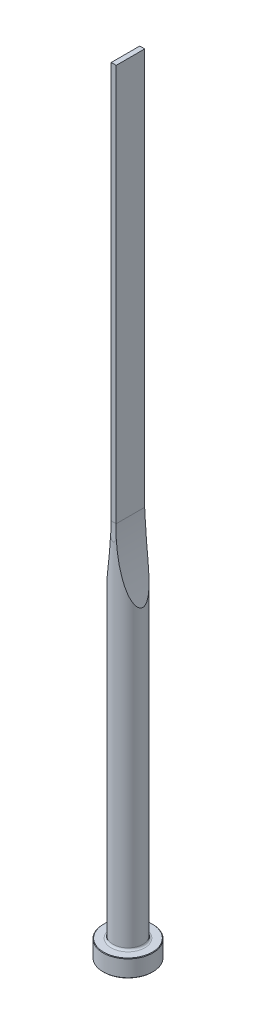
ISO-10303-21;
HEADER;
FILE_DESCRIPTION(('STEP AP214'),'2;1');
FILE_NAME('part.step','',(''),(''),'','','');
FILE_SCHEMA(('AUTOMOTIVE_DESIGN { 1 0 10303 214 1 1 1 1 }'));
ENDSEC;
DATA;
#1=APPLICATION_CONTEXT('core data for automotive mechanical design processes');
#2=APPLICATION_PROTOCOL_DEFINITION('international standard','automotive_design',2000,#1);
#3=PRODUCT_CONTEXT('',#1,'mechanical');
#4=PRODUCT('Part','Part','',(#3));
#5=PRODUCT_RELATED_PRODUCT_CATEGORY('part','',(#4));
#6=PRODUCT_DEFINITION_FORMATION('','',#4);
#7=PRODUCT_DEFINITION_CONTEXT('part definition',#1,'design');
#8=PRODUCT_DEFINITION('design','',#6,#7);
#9=PRODUCT_DEFINITION_SHAPE('','',#8);
#10=(LENGTH_UNIT() NAMED_UNIT(*) SI_UNIT(.MILLI.,.METRE.));
#11=(NAMED_UNIT(*) PLANE_ANGLE_UNIT() SI_UNIT($,.RADIAN.));
#12=(NAMED_UNIT(*) SI_UNIT($,.STERADIAN.) SOLID_ANGLE_UNIT());
#13=UNCERTAINTY_MEASURE_WITH_UNIT(LENGTH_MEASURE(1.E-05),#10,'distance_accuracy_value','');
#14=(GEOMETRIC_REPRESENTATION_CONTEXT(3) GLOBAL_UNCERTAINTY_ASSIGNED_CONTEXT((#13)) GLOBAL_UNIT_ASSIGNED_CONTEXT((#10,
#11,#12)) REPRESENTATION_CONTEXT('',''));
#15=CARTESIAN_POINT('',(0.,0.,0.));
#16=DIRECTION('',(0.,0.,1.));
#17=DIRECTION('',(1.,0.,0.));
#18=AXIS2_PLACEMENT_3D('',#15,#16,#17);
#19=CARTESIAN_POINT('',(0.,0.,0.));
#20=DIRECTION('',(0.,1.,0.));
#21=DIRECTION('',(-1.,0.,0.));
#22=AXIS2_PLACEMENT_3D('',#19,#20,#21);
#23=PLANE('',#22);
#24=CARTESIAN_POINT('',(0.,0.,0.));
#25=DIRECTION('',(0.,1.,0.));
#26=DIRECTION('',(-1.,0.,0.));
#27=AXIS2_PLACEMENT_3D('',#24,#25,#26);
#28=CIRCLE('',#27,9.8);
#29=CARTESIAN_POINT('',(-9.8,0.,0.));
#30=VERTEX_POINT('',#29);
#31=EDGE_CURVE('E133',#30,#30,#28,.T.);
#32=ORIENTED_EDGE('',*,*,#31,.F.);
#33=EDGE_LOOP('',(#32));
#34=FACE_BOUND('',#33,.T.);
#35=ADVANCED_FACE('F32',(#34),#23,.F.);
#36=CARTESIAN_POINT('',(0.,0.,0.));
#37=DIRECTION('',(0.,1.,0.));
#38=DIRECTION('',(-1.,0.,0.));
#39=AXIS2_PLACEMENT_3D('',#36,#37,#38);
#40=CONICAL_SURFACE('',#39,9.8,0.785398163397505);
#41=CARTESIAN_POINT('',(0.,0.199999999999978,0.));
#42=DIRECTION('',(0.,1.,0.));
#43=DIRECTION('',(-1.,0.,0.));
#44=AXIS2_PLACEMENT_3D('',#41,#42,#43);
#45=CIRCLE('',#44,10.);
#46=CARTESIAN_POINT('',(-10.,0.199999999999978,0.));
#47=VERTEX_POINT('',#46);
#48=EDGE_CURVE('E130',#47,#47,#45,.T.);
#49=ORIENTED_EDGE('',*,*,#48,.F.);
#50=EDGE_LOOP('',(#49));
#51=FACE_BOUND('',#50,.T.);
#52=ORIENTED_EDGE('',*,*,#31,.T.);
#53=EDGE_LOOP('',(#52));
#54=FACE_BOUND('',#53,.T.);
#55=ADVANCED_FACE('F171',(#51,#54),#40,.T.);
#56=CARTESIAN_POINT('',(0.,315.,0.));
#57=DIRECTION('',(0.,1.,0.));
#58=DIRECTION('',(-1.,0.,0.));
#59=AXIS2_PLACEMENT_3D('',#56,#57,#58);
#60=CYLINDRICAL_SURFACE('',#59,10.);
#61=CARTESIAN_POINT('',(0.,6.79999999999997,0.));
#62=DIRECTION('',(0.,1.,0.));
#63=DIRECTION('',(-1.,0.,0.));
#64=AXIS2_PLACEMENT_3D('',#61,#62,#63);
#65=CIRCLE('',#64,10.);
#66=CARTESIAN_POINT('',(-10.,6.79999999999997,0.));
#67=VERTEX_POINT('',#66);
#68=EDGE_CURVE('E127',#67,#67,#65,.T.);
#69=ORIENTED_EDGE('',*,*,#68,.F.);
#70=EDGE_LOOP('',(#69));
#71=FACE_BOUND('',#70,.T.);
#72=ORIENTED_EDGE('',*,*,#48,.T.);
#73=EDGE_LOOP('',(#72));
#74=FACE_BOUND('',#73,.T.);
#75=ADVANCED_FACE('F176',(#71,#74),#60,.T.);
#76=CARTESIAN_POINT('',(0.,6.79999999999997,0.));
#77=DIRECTION('',(0.,-1.,0.));
#78=DIRECTION('',(1.,0.,0.));
#79=AXIS2_PLACEMENT_3D('',#76,#77,#78);
#80=CONICAL_SURFACE('',#79,10.,0.785398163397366);
#81=CARTESIAN_POINT('',(0.,7.00000000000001,0.));
#82=DIRECTION('',(0.,1.,0.));
#83=DIRECTION('',(-1.,0.,0.));
#84=AXIS2_PLACEMENT_3D('',#81,#82,#83);
#85=CIRCLE('',#84,9.8);
#86=CARTESIAN_POINT('',(-9.8,7.00000000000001,0.));
#87=VERTEX_POINT('',#86);
#88=EDGE_CURVE('E124',#87,#87,#85,.T.);
#89=ORIENTED_EDGE('',*,*,#88,.F.);
#90=EDGE_LOOP('',(#89));
#91=FACE_BOUND('',#90,.T.);
#92=ORIENTED_EDGE('',*,*,#68,.T.);
#93=EDGE_LOOP('',(#92));
#94=FACE_BOUND('',#93,.T.);
#95=ADVANCED_FACE('F183',(#91,#94),#80,.T.);
#96=CARTESIAN_POINT('',(9.8,7.,0.));
#97=DIRECTION('',(0.,-1.,0.));
#98=DIRECTION('',(1.,0.,0.));
#99=AXIS2_PLACEMENT_3D('',#96,#97,#98);
#100=PLANE('',#99);
#101=CARTESIAN_POINT('',(0.,7.00000000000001,0.));
#102=DIRECTION('',(0.,1.,0.));
#103=DIRECTION('',(-1.,0.,0.));
#104=AXIS2_PLACEMENT_3D('',#101,#102,#103);
#105=CIRCLE('',#104,6.80000000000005);
#106=CARTESIAN_POINT('',(-6.80000000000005,7.00000000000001,0.));
#107=VERTEX_POINT('',#106);
#108=EDGE_CURVE('E121',#107,#107,#105,.T.);
#109=ORIENTED_EDGE('',*,*,#108,.F.);
#110=EDGE_LOOP('',(#109));
#111=FACE_BOUND('',#110,.T.);
#112=ORIENTED_EDGE('',*,*,#88,.T.);
#113=EDGE_LOOP('',(#112));
#114=FACE_BOUND('',#113,.T.);
#115=ADVANCED_FACE('F190',(#111,#114),#100,.F.);
#116=CARTESIAN_POINT('',(0.,7.8,0.));
#117=DIRECTION('',(0.,1.,0.));
#118=DIRECTION('',(-1.,0.,0.));
#119=AXIS2_PLACEMENT_3D('',#116,#117,#118);
#120=TOROIDAL_SURFACE('',#119,6.80000000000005,0.8);
#121=CARTESIAN_POINT('',(0.,7.79999999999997,0.));
#122=DIRECTION('',(0.,1.,0.));
#123=DIRECTION('',(-1.,0.,0.));
#124=AXIS2_PLACEMENT_3D('',#121,#122,#123);
#125=CIRCLE('',#124,6.00000000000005);
#126=CARTESIAN_POINT('',(-6.00000000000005,7.79999999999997,0.));
#127=VERTEX_POINT('',#126);
#128=EDGE_CURVE('E112',#127,#127,#125,.T.);
#129=ORIENTED_EDGE('',*,*,#128,.F.);
#130=EDGE_LOOP('',(#129));
#131=FACE_BOUND('',#130,.T.);
#132=ORIENTED_EDGE('',*,*,#108,.T.);
#133=EDGE_LOOP('',(#132));
#134=FACE_BOUND('',#133,.T.);
#135=ADVANCED_FACE('F168',(#131,#134),#120,.F.);
#136=CARTESIAN_POINT('',(0.,315.,0.));
#137=DIRECTION('',(0.,1.,0.));
#138=DIRECTION('',(-1.,0.,0.));
#139=AXIS2_PLACEMENT_3D('',#136,#137,#138);
#140=CYLINDRICAL_SURFACE('',#139,6.00000000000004);
#141=CARTESIAN_POINT('',(6.00000000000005,125.419601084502,0.));
#142=CARTESIAN_POINT('',(5.99999775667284,125.419607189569,0.125242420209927));
#143=CARTESIAN_POINT('',(5.99603096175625,125.430998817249,0.250508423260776));
#144=CARTESIAN_POINT('',(5.98067932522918,125.475169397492,0.496760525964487));
#145=CARTESIAN_POINT('',(5.96928446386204,125.507977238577,0.617740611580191));
#146=CARTESIAN_POINT('',(5.93705304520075,125.601055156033,0.878870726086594));
#147=CARTESIAN_POINT('',(5.91466618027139,125.66585155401,1.01718646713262));
#148=CARTESIAN_POINT('',(5.86320143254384,125.815556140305,1.28103782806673));
#149=CARTESIAN_POINT('',(5.83411053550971,125.900503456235,1.4065478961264));
#150=CARTESIAN_POINT('',(5.77681570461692,126.068782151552,1.62443423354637));
#151=CARTESIAN_POINT('',(5.74932751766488,126.149855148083,1.71878790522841));
#152=CARTESIAN_POINT('',(5.69208960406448,126.319545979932,1.89977178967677));
#153=CARTESIAN_POINT('',(5.6623382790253,126.408169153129,1.98639644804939));
#154=CARTESIAN_POINT('',(5.6011787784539,126.591362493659,2.1528285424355));
#155=CARTESIAN_POINT('',(5.56976730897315,126.685944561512,2.2326215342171));
#156=CARTESIAN_POINT('',(5.50582406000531,126.879610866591,2.38595788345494));
#157=CARTESIAN_POINT('',(5.47329254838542,126.978694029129,2.4595027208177));
#158=CARTESIAN_POINT('',(5.3971573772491,127.212004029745,2.62320522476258));
#159=CARTESIAN_POINT('',(5.35327162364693,127.347534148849,2.71136896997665));
#160=CARTESIAN_POINT('',(5.26471235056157,127.623340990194,2.87955370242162));
#161=CARTESIAN_POINT('',(5.22003850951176,127.763619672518,2.95957127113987));
#162=CARTESIAN_POINT('',(5.13024375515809,128.048056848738,3.11263236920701));
#163=CARTESIAN_POINT('',(5.08512228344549,128.192220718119,3.18566552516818));
#164=CARTESIAN_POINT('',(4.99477653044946,128.483499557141,3.32552790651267));
#165=CARTESIAN_POINT('',(4.94955223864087,128.630614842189,3.39235646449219));
#166=CARTESIAN_POINT('',(4.85901090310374,128.927902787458,3.52082581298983));
#167=CARTESIAN_POINT('',(4.81369435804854,129.078086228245,3.5824419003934));
#168=CARTESIAN_POINT('',(4.72333124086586,129.380450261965,3.70076774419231));
#169=CARTESIAN_POINT('',(4.67828467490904,129.532630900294,3.7574773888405));
#170=CARTESIAN_POINT('',(4.58862652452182,129.838523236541,3.8664557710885));
#171=CARTESIAN_POINT('',(4.54401457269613,129.992233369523,3.91872861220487));
#172=CARTESIAN_POINT('',(4.45527805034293,130.301074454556,4.01932733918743));
#173=CARTESIAN_POINT('',(4.41115348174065,130.456205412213,4.06765320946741));
#174=CARTESIAN_POINT('',(4.29641025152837,130.863804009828,4.18945912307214));
#175=CARTESIAN_POINT('',(4.22624526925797,131.117262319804,4.26005871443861));
#176=CARTESIAN_POINT('',(4.08762442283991,131.626752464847,4.39323954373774));
#177=CARTESIAN_POINT('',(4.01916875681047,131.882784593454,4.45581985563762));
#178=CARTESIAN_POINT('',(3.88411563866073,132.397049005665,4.57402486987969));
#179=CARTESIAN_POINT('',(3.8175189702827,132.655282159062,4.62964667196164));
#180=CARTESIAN_POINT('',(3.68633760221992,133.173506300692,4.73476129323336));
#181=CARTESIAN_POINT('',(3.62175301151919,133.433497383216,4.78425378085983));
#182=CARTESIAN_POINT('',(3.43093594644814,134.216641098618,4.92481121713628));
#183=CARTESIAN_POINT('',(3.30788392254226,134.742036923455,5.00774895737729));
#184=CARTESIAN_POINT('',(3.07078215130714,135.79726021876,5.15653257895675));
#185=CARTESIAN_POINT('',(2.95673337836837,136.327088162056,5.22237661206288));
#186=CARTESIAN_POINT('',(2.79250802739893,137.125090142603,5.31090921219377));
#187=CARTESIAN_POINT('',(2.73884045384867,137.391992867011,5.33874481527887));
#188=CARTESIAN_POINT('',(2.63387849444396,137.926548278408,5.39130136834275));
#189=CARTESIAN_POINT('',(2.5825839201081,138.194200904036,5.41602256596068));
#190=CARTESIAN_POINT('',(2.43228253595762,138.998226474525,5.4860046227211));
#191=CARTESIAN_POINT('',(2.33686353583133,139.535640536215,5.52708106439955));
#192=CARTESIAN_POINT('',(2.1558289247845,140.612127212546,5.60016992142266));
#193=CARTESIAN_POINT('',(2.07020309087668,141.15119748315,5.63219184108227));
#194=CARTESIAN_POINT('',(1.90872365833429,142.231186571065,5.68894511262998));
#195=CARTESIAN_POINT('',(1.83287021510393,142.772105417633,5.71367634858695));
#196=CARTESIAN_POINT('',(1.69120784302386,143.853864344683,5.75719432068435));
#197=CARTESIAN_POINT('',(1.62536994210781,144.3946999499,5.77599837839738));
#198=CARTESIAN_POINT('',(1.50351191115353,145.477630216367,5.80890983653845));
#199=CARTESIAN_POINT('',(1.44749203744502,146.019724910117,5.82301711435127));
#200=CARTESIAN_POINT('',(1.34529714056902,147.104979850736,5.84747253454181));
#201=CARTESIAN_POINT('',(1.29912312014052,147.648140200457,5.85782029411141));
#202=CARTESIAN_POINT('',(1.21664859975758,148.73525968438,5.87550372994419));
#203=CARTESIAN_POINT('',(1.18034813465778,149.279218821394,5.88283939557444));
#204=CARTESIAN_POINT('',(1.11760674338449,150.368246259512,5.89508076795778));
#205=CARTESIAN_POINT('',(1.09117513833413,150.913315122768,5.8999841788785));
#206=CARTESIAN_POINT('',(1.04823003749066,152.003858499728,5.90776520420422));
#207=CARTESIAN_POINT('',(1.03171656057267,152.549333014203,5.91064281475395));
#208=CARTESIAN_POINT('',(1.00861478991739,153.640462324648,5.91462876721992));
#209=CARTESIAN_POINT('',(1.00202583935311,154.186117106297,5.9157372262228));
#210=CARTESIAN_POINT('',(0.998773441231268,155.277468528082,5.91628720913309));
#211=CARTESIAN_POINT('',(1.00211020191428,155.823165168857,5.91572869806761));
#212=CARTESIAN_POINT('',(1.01869111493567,156.913263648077,5.91289599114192));
#213=CARTESIAN_POINT('',(1.03191456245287,157.45766581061,5.91062538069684));
#214=CARTESIAN_POINT('',(1.0682394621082,158.546117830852,5.90416844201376));
#215=CARTESIAN_POINT('',(1.09134070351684,159.090167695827,5.89998215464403));
#216=CARTESIAN_POINT('',(1.14741473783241,160.177785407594,5.88933394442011));
#217=CARTESIAN_POINT('',(1.18038841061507,160.721353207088,5.88287181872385));
#218=CARTESIAN_POINT('',(1.25619292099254,161.807759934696,5.86715249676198));
#219=CARTESIAN_POINT('',(1.29902372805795,162.350598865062,5.85789530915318));
#220=CARTESIAN_POINT('',(1.39447993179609,163.434849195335,5.83590809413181));
#221=CARTESIAN_POINT('',(1.44709640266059,163.976261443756,5.82318122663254));
#222=CARTESIAN_POINT('',(1.56212230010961,165.057923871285,5.7933846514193));
#223=CARTESIAN_POINT('',(1.62453165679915,165.598174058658,5.7763149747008));
#224=CARTESIAN_POINT('',(1.75909505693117,166.677175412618,5.73676759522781));
#225=CARTESIAN_POINT('',(1.83124753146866,167.215926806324,5.71429076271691));
#226=CARTESIAN_POINT('',(1.98524953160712,168.291705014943,5.66263106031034));
#227=CARTESIAN_POINT('',(2.06709862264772,168.828731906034,5.63344849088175));
#228=CARTESIAN_POINT('',(2.21300385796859,169.731161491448,5.57733188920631));
#229=CARTESIAN_POINT('',(2.27449844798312,170.09711766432,5.55260662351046));
#230=CARTESIAN_POINT('',(2.40194906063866,170.827916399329,5.49867559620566));
#231=CARTESIAN_POINT('',(2.4679049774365,171.192758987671,5.4694699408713));
#232=CARTESIAN_POINT('',(2.60424949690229,171.921248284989,5.40588058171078));
#233=CARTESIAN_POINT('',(2.67463906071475,172.284894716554,5.37149575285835));
#234=CARTESIAN_POINT('',(2.81977842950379,173.010704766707,5.29674573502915));
#235=CARTESIAN_POINT('',(2.89452823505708,173.372868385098,5.25638054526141));
#236=CARTESIAN_POINT('',(3.0482046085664,174.094966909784,5.16877779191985));
#237=CARTESIAN_POINT('',(3.12712545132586,174.454904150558,5.12154950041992));
#238=CARTESIAN_POINT('',(3.28912302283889,175.172689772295,5.01904986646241));
#239=CARTESIAN_POINT('',(3.37219962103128,175.530538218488,4.96377877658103));
#240=CARTESIAN_POINT('',(3.54231681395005,176.24353801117,4.8438438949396));
#241=CARTESIAN_POINT('',(3.62935549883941,176.598690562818,4.7791845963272));
#242=CARTESIAN_POINT('',(3.80720655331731,177.305820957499,4.63875280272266));
#243=CARTESIAN_POINT('',(3.89801851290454,177.657799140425,4.56298151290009));
#244=CARTESIAN_POINT('',(4.08342709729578,178.358966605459,4.39785138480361));
#245=CARTESIAN_POINT('',(4.17803592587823,178.708141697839,4.30844562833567));
#246=CARTESIAN_POINT('',(4.37029964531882,179.401317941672,4.11330947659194));
#247=CARTESIAN_POINT('',(4.46795582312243,179.745316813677,4.00757210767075));
#248=CARTESIAN_POINT('',(4.61614246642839,180.255904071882,3.83366636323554));
#249=CARTESIAN_POINT('',(4.66586049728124,180.425325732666,3.773095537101));
#250=CARTESIAN_POINT('',(4.76568777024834,180.761874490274,3.64619669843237));
#251=CARTESIAN_POINT('',(4.81579697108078,180.929001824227,3.57986928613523));
#252=CARTESIAN_POINT('',(4.91617313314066,181.260325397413,3.44072598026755));
#253=CARTESIAN_POINT('',(4.96643993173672,181.424523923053,3.36791544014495));
#254=CARTESIAN_POINT('',(5.06689358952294,181.749394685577,3.21480576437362));
#255=CARTESIAN_POINT('',(5.11708046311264,181.910067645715,3.13450818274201));
#256=CARTESIAN_POINT('',(5.21752644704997,182.228576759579,2.96433606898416));
#257=CARTESIAN_POINT('',(5.26778094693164,182.386366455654,2.87437116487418));
#258=CARTESIAN_POINT('',(5.3672544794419,182.695834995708,2.68404781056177));
#259=CARTESIAN_POINT('',(5.41647403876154,182.847516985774,2.58369480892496));
#260=CARTESIAN_POINT('',(5.51277525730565,183.141752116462,2.37125323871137));
#261=CARTESIAN_POINT('',(5.55986802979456,183.284354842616,2.25923918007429));
#262=CARTESIAN_POINT('',(5.65090527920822,183.557883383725,2.02077972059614));
#263=CARTESIAN_POINT('',(5.69485490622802,183.688828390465,1.89435885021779));
#264=CARTESIAN_POINT('',(5.76730290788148,183.903231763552,1.65813330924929));
#265=CARTESIAN_POINT('',(5.79691960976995,183.990384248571,1.55205897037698));
#266=CARTESIAN_POINT('',(5.85202977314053,184.151851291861,1.32925640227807));
#267=CARTESIAN_POINT('',(5.87752021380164,184.226156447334,1.2125204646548));
#268=CARTESIAN_POINT('',(5.9229180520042,184.358049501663,0.966850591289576));
#269=CARTESIAN_POINT('',(5.94275517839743,184.415427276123,0.837787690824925));
#270=CARTESIAN_POINT('',(5.97430478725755,184.506499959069,0.570644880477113));
#271=CARTESIAN_POINT('',(5.98603519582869,184.540247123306,0.432585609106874));
#272=CARTESIAN_POINT('',(5.99919214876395,184.578084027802,0.16276688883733));
#273=CARTESIAN_POINT('',(6.00134328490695,184.584259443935,0.0313422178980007));
#274=CARTESIAN_POINT('',(5.99700901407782,184.571803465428,-0.230194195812));
#275=CARTESIAN_POINT('',(5.99052146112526,184.553165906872,-0.360305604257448));
#276=CARTESIAN_POINT('',(5.97128614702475,184.497771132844,-0.596490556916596));
#277=CARTESIAN_POINT('',(5.95955071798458,184.463941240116,-0.703365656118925));
#278=CARTESIAN_POINT('',(5.93136732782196,184.382471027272,-0.910966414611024));
#279=CARTESIAN_POINT('',(5.91491844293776,184.334827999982,-1.01169086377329));
#280=CARTESIAN_POINT('',(5.86553987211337,184.191312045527,-1.27427049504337));
#281=CARTESIAN_POINT('',(5.82912016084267,184.084985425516,-1.42972634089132));
#282=CARTESIAN_POINT('',(5.74961855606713,183.851132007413,-1.7219098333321));
#283=CARTESIAN_POINT('',(5.70651443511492,183.723534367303,-1.85857201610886));
#284=CARTESIAN_POINT('',(5.61897824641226,183.462238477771,-2.10794871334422));
#285=CARTESIAN_POINT('',(5.57477388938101,183.32934207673,-2.22159958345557));
#286=CARTESIAN_POINT('',(5.48416424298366,183.054639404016,-2.43671420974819));
#287=CARTESIAN_POINT('',(5.43775690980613,182.912824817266,-2.53816632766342));
#288=CARTESIAN_POINT('',(5.3435832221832,182.622483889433,-2.7308663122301));
#289=CARTESIAN_POINT('',(5.29581433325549,182.473944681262,-2.82209334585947));
#290=CARTESIAN_POINT('',(5.19962805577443,182.17206815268,-2.9956114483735));
#291=CARTESIAN_POINT('',(5.15121092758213,182.018732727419,-3.07790599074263));
#292=CARTESIAN_POINT('',(5.02856678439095,181.626569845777,-3.27618912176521));
#293=CARTESIAN_POINT('',(4.95417194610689,181.385234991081,-3.38710592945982));
#294=CARTESIAN_POINT('',(4.80575902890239,180.89629733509,-3.59456631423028));
#295=CARTESIAN_POINT('',(4.73174116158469,180.648691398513,-3.69110252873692));
#296=CARTESIAN_POINT('',(4.58458577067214,180.148444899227,-3.87236575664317));
#297=CARTESIAN_POINT('',(4.5114500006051,179.895796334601,-3.95707195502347));
#298=CARTESIAN_POINT('',(4.36658882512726,179.386924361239,-4.11636762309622));
#299=CARTESIAN_POINT('',(4.29486358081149,179.130700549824,-4.19095594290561));
#300=CARTESIAN_POINT('',(4.15278444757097,178.614258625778,-4.33179261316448));
#301=CARTESIAN_POINT('',(4.08243835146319,178.354027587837,-4.39800116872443));
#302=CARTESIAN_POINT('',(3.9436565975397,177.831255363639,-4.52286201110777));
#303=CARTESIAN_POINT('',(3.87522100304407,177.568714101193,-4.58151404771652));
#304=CARTESIAN_POINT('',(3.74048483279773,177.042023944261,-4.69215969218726));
#305=CARTESIAN_POINT('',(3.67418193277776,176.777877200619,-4.74416074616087));
#306=CARTESIAN_POINT('',(3.54373924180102,176.247986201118,-4.84237219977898));
#307=CARTESIAN_POINT('',(3.47959944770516,175.982241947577,-4.88858260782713));
#308=CARTESIAN_POINT('',(3.31010347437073,175.265635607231,-5.00599993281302));
#309=CARTESIAN_POINT('',(3.20682871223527,174.813500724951,-5.07246697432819));
#310=CARTESIAN_POINT('',(3.00696752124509,173.906139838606,-5.19343466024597));
#311=CARTESIAN_POINT('',(2.91038185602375,173.450913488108,-5.24793393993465));
#312=CARTESIAN_POINT('',(2.72405514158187,172.537809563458,-5.34702333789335));
#313=CARTESIAN_POINT('',(2.63431680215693,172.079931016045,-5.39160954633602));
#314=CARTESIAN_POINT('',(2.46185131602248,171.1621246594,-5.47250894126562));
#315=CARTESIAN_POINT('',(2.3791243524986,170.702196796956,-5.50882191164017));
#316=CARTESIAN_POINT('',(2.22060946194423,169.779692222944,-5.57460936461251));
#317=CARTESIAN_POINT('',(2.14483606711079,169.317112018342,-5.60406971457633));
#318=CARTESIAN_POINT('',(2.00048108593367,168.390500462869,-5.65720666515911));
#319=CARTESIAN_POINT('',(1.93189955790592,167.926469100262,-5.68088321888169));
#320=CARTESIAN_POINT('',(1.80198761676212,166.997274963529,-5.72341801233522));
#321=CARTESIAN_POINT('',(1.74065566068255,166.532112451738,-5.74227727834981));
#322=CARTESIAN_POINT('',(1.62525795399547,165.60074053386,-5.77599627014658));
#323=CARTESIAN_POINT('',(1.57119233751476,165.13453110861,-5.79085592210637));
#324=CARTESIAN_POINT('',(1.41952321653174,163.73077775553,-5.83061132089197));
#325=CARTESIAN_POINT('',(1.33297412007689,162.791873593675,-5.85052312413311));
#326=CARTESIAN_POINT('',(1.18941363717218,160.911655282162,-5.88138038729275));
#327=CARTESIAN_POINT('',(1.13240356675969,159.970341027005,-5.89232544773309));
#328=CARTESIAN_POINT('',(1.04805147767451,158.087652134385,-5.90791250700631));
#329=CARTESIAN_POINT('',(1.0206679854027,157.14627943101,-5.91256331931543));
#330=CARTESIAN_POINT('',(0.995458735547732,155.263151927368,-5.91685902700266));
#331=CARTESIAN_POINT('',(0.997632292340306,154.32139713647,-5.91650403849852));
#332=CARTESIAN_POINT('',(1.03154557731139,152.437741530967,-5.91068654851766));
#333=CARTESIAN_POINT('',(1.0633069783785,151.495841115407,-5.90522030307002));
#334=CARTESIAN_POINT('',(1.15639203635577,149.613524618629,-5.88769860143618));
#335=CARTESIAN_POINT('',(1.21771697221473,148.673108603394,-5.87564286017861));
#336=CARTESIAN_POINT('',(1.37003026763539,146.792670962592,-5.84201750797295));
#337=CARTESIAN_POINT('',(1.46108548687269,145.852655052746,-5.82042641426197));
#338=CARTESIAN_POINT('',(1.61976731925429,144.44553016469,-5.77748168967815));
#339=CARTESIAN_POINT('',(1.67634191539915,143.976989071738,-5.76140789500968));
#340=CARTESIAN_POINT('',(1.79683049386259,143.041021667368,-5.7249785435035));
#341=CARTESIAN_POINT('',(1.86074431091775,142.573595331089,-5.70462308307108));
#342=CARTESIAN_POINT('',(1.99506969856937,141.645616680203,-5.6590338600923));
#343=CARTESIAN_POINT('',(2.06539470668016,141.18504885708,-5.63386115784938));
#344=CARTESIAN_POINT('',(2.21312421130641,140.265429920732,-5.57748469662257));
#345=CARTESIAN_POINT('',(2.29052848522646,139.806378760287,-5.54628112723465));
#346=CARTESIAN_POINT('',(2.45239786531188,138.889790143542,-5.47663362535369));
#347=CARTESIAN_POINT('',(2.53686705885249,138.43225372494,-5.43818548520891));
#348=CARTESIAN_POINT('',(2.7127293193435,137.519327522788,-5.35263180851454));
#349=CARTESIAN_POINT('',(2.80412221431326,137.063937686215,-5.30552648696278));
#350=CARTESIAN_POINT('',(2.99332338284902,136.15753834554,-5.20112020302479));
#351=CARTESIAN_POINT('',(3.09110511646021,135.706518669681,-5.14385991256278));
#352=CARTESIAN_POINT('',(3.29321309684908,134.807631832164,-5.01687239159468));
#353=CARTESIAN_POINT('',(3.3975400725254,134.359765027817,-4.94714377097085));
#354=CARTESIAN_POINT('',(3.61229869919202,133.468639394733,-4.79257698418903));
#355=CARTESIAN_POINT('',(3.722723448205,133.025376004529,-4.70775566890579));
#356=CARTESIAN_POINT('',(3.9492867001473,132.144366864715,-4.51939233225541));
#357=CARTESIAN_POINT('',(4.06542330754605,131.706619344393,-4.41585649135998));
#358=CARTESIAN_POINT('',(4.20946974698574,131.179563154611,-4.2756998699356));
#359=CARTESIAN_POINT('',(4.23504568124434,131.086573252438,-4.25037819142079));
#360=CARTESIAN_POINT('',(4.28641223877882,130.90097588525,-4.19857173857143));
#361=CARTESIAN_POINT('',(4.31220286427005,130.808368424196,-4.17208695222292));
#362=CARTESIAN_POINT('',(4.38988595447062,130.531142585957,-4.09078536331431));
#363=CARTESIAN_POINT('',(4.44208320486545,130.347144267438,-4.03412754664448));
#364=CARTESIAN_POINT('',(4.54731866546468,129.98060054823,-3.9151273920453));
#365=CARTESIAN_POINT('',(4.60035886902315,129.798060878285,-3.85276910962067));
#366=CARTESIAN_POINT('',(4.70696776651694,129.435409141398,-3.72177186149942));
#367=CARTESIAN_POINT('',(4.76053642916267,129.255296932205,-3.65313326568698));
#368=CARTESIAN_POINT('',(4.87563201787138,128.872646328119,-3.49839982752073));
#369=CARTESIAN_POINT('',(4.93720737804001,128.670561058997,-3.4112106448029));
#370=CARTESIAN_POINT('',(5.06030283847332,128.271512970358,-3.22579089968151));
#371=CARTESIAN_POINT('',(5.12182294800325,128.074549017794,-3.12756280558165));
#372=CARTESIAN_POINT('',(5.24391728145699,127.688186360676,-2.91821502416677));
#373=CARTESIAN_POINT('',(5.30449407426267,127.498763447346,-2.80714197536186));
#374=CARTESIAN_POINT('',(5.42380766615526,127.129715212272,-2.56905944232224));
#375=CARTESIAN_POINT('',(5.48254648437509,126.950078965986,-2.44206827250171));
#376=CARTESIAN_POINT('',(5.58357518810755,126.644150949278,-2.19927757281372));
#377=CARTESIAN_POINT('',(5.62658135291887,126.514981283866,-2.08743966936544));
#378=CARTESIAN_POINT('',(5.70919774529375,126.268555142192,-1.8495785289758));
#379=CARTESIAN_POINT('',(5.74880272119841,126.151317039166,-1.72353402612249));
#380=CARTESIAN_POINT('',(5.82301089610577,125.932939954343,-1.45343537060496));
#381=CARTESIAN_POINT('',(5.85753618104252,125.832049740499,-1.30915348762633));
#382=CARTESIAN_POINT('',(5.91754549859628,125.657462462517,-1.00330272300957));
#383=CARTESIAN_POINT('',(5.94306640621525,125.58365443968,-0.84180795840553));
#384=CARTESIAN_POINT('',(5.97431451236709,125.493488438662,-0.565200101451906));
#385=CARTESIAN_POINT('',(5.98385628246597,125.466025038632,-0.454147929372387));
#386=CARTESIAN_POINT('',(5.99669757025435,125.429085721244,-0.228735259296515));
#387=CARTESIAN_POINT('',(6.00000204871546,125.419595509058,-0.114377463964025));
#388=CARTESIAN_POINT('',(6.00000000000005,125.419601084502,0.));
#389=B_SPLINE_CURVE_WITH_KNOTS('',3,(#141,#142,#143,#144,#145,#146,#147,#148,#149,#150,#151,
#152,#153,#154,#155,#156,#157,#158,#159,#160,#161,#162,#163,#164,#165,#166,#167,#168,#169,#170,
#171,#172,#173,#174,#175,#176,#177,#178,#179,#180,#181,#182,#183,#184,#185,#186,#187,#188,#189,
#190,#191,#192,#193,#194,#195,#196,#197,#198,#199,#200,#201,#202,#203,#204,#205,#206,#207,#208,
#209,#210,#211,#212,#213,#214,#215,#216,#217,#218,#219,#220,#221,#222,#223,#224,#225,#226,#227,
#228,#229,#230,#231,#232,#233,#234,#235,#236,#237,#238,#239,#240,#241,#242,#243,#244,#245,#246,
#247,#248,#249,#250,#251,#252,#253,#254,#255,#256,#257,#258,#259,#260,#261,#262,#263,#264,#265,
#266,#267,#268,#269,#270,#271,#272,#273,#274,#275,#276,#277,#278,#279,#280,#281,#282,#283,#284,
#285,#286,#287,#288,#289,#290,#291,#292,#293,#294,#295,#296,#297,#298,#299,#300,#301,#302,#303,
#304,#305,#306,#307,#308,#309,#310,#311,#312,#313,#314,#315,#316,#317,#318,#319,#320,#321,#322,
#323,#324,#325,#326,#327,#328,#329,#330,#331,#332,#333,#334,#335,#336,#337,#338,#339,#340,#341,
#342,#343,#344,#345,#346,#347,#348,#349,#350,#351,#352,#353,#354,#355,#356,#357,#358,#359,#360,
#361,#362,#363,#364,#365,#366,#367,#368,#369,#370,#371,#372,#373,#374,#375,#376,#377,#378,#379,
#380,#381,#382,#383,#384,#385,#386,#387,#388),.UNSPECIFIED.,.T.,.F.,(4,2,2,2,2,2,2,2,2,2,2,2,2,
2,2,2,2,2,2,2,2,2,2,2,2,2,2,2,2,2,2,2,2,2,2,2,2,2,2,2,2,2,2,2,2,2,2,2,2,2,2,2,2,2,2,2,2,2,2,2,2,
2,2,2,2,2,2,2,2,2,2,2,2,2,2,2,2,2,2,2,2,2,2,2,2,2,2,2,2,2,2,2,2,2,2,2,2,2,2,2,2,2,2,2,2,2,2,2,2,
2,2,2,2,2,2,2,2,2,2,2,2,2,2,4),(0.,0.375228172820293,0.750963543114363,1.21148286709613,
1.67290382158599,2.05457288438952,2.43651405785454,2.81924379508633,3.20188262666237,
3.70413932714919,4.20660593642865,4.70980759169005,5.21306331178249,5.71858410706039,
6.22411641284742,6.7291759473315,7.23423747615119,8.0509724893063,8.86780173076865,
9.68497029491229,10.5021830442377,12.1395484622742,13.7770908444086,14.5980582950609,
15.418960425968,17.0608465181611,18.7010027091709,20.3411849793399,21.9765285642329,
23.6119148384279,25.2474675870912,26.8830261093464,28.5201255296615,30.1572280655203,
31.7942222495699,33.4312507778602,35.0648605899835,36.6984355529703,38.332156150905,
39.9658716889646,41.5981043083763,43.230325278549,44.8622837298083,46.4941690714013,
47.6098499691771,48.7255044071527,49.8414015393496,50.9572988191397,52.0717022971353,
53.18607078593,54.2999076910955,55.4136238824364,56.5312628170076,57.6493803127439,
58.2092978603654,58.7691570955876,59.3285582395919,59.8878435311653,60.4529069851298,
61.0176755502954,61.5790343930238,62.1394513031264,62.5599677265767,62.9807906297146,
63.4066365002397,63.8315376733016,64.2236842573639,64.6159282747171,64.9528337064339,
65.2898052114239,65.8619626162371,66.4360650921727,66.9763567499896,67.5171598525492,
68.0590455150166,68.6007196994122,69.4275798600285,70.2548619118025,71.0835817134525,
71.9123956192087,72.7450085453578,73.577649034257,74.409349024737,75.241047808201,
76.6463331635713,78.0517786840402,79.4577775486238,80.8638131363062,82.2727232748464,
83.6816448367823,85.0902659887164,86.4989131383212,89.327615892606,92.1564446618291,
94.9813082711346,97.8061063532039,100.632975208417,103.45996636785,106.293359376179,
107.709950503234,109.126509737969,110.52617864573,111.925803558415,113.326243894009,
114.726649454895,116.121567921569,117.516642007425,118.910168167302,120.303234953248,
120.602364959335,120.901498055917,121.499839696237,122.099909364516,122.699943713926,
123.385305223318,124.070513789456,124.753308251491,125.435324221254,125.963134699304,
126.491746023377,127.027768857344,127.561570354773,127.904519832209,128.247196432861),.UNSPECIFIED.);
#390=CARTESIAN_POINT('',(1.14059027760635,149.971433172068,-5.89059027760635));
#391=VERTEX_POINT('',#390);
#392=CARTESIAN_POINT('',(1.14059027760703,149.971433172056,5.89059027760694));
#393=VERTEX_POINT('',#392);
#394=EDGE_CURVE('E138',#391,#393,#389,.T.);
#395=ORIENTED_EDGE('',*,*,#394,.T.);
#396=CARTESIAN_POINT('',(-1.71391365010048,155.,5.74999999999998));
#397=CARTESIAN_POINT('',(-1.71391988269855,155.360232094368,5.7500002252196));
#398=CARTESIAN_POINT('',(-1.7067069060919,155.7204849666,5.75216429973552));
#399=CARTESIAN_POINT('',(-1.6773027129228,156.440311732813,5.76080572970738));
#400=CARTESIAN_POINT('',(-1.65511191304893,156.799885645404,5.76728296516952));
#401=CARTESIAN_POINT('',(-1.59385315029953,157.518394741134,5.78452322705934));
#402=CARTESIAN_POINT('',(-1.55474710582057,157.87732663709,5.79529591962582));
#403=CARTESIAN_POINT('',(-1.48033674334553,158.41327242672,5.81457014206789));
#404=CARTESIAN_POINT('',(-1.45292096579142,158.591447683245,5.82151097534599));
#405=CARTESIAN_POINT('',(-1.39191289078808,158.946689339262,5.83640137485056));
#406=CARTESIAN_POINT('',(-1.35832152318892,159.123755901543,5.8443507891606));
#407=CARTESIAN_POINT('',(-1.29127878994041,159.440079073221,5.85948118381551));
#408=CARTESIAN_POINT('',(-1.25921382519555,159.579636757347,5.866484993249));
#409=CARTESIAN_POINT('',(-1.18926063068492,159.857383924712,5.88106678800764));
#410=CARTESIAN_POINT('',(-1.15136840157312,159.995572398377,5.88864516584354));
#411=CARTESIAN_POINT('',(-1.06831244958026,160.269233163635,5.90427715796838));
#412=CARTESIAN_POINT('',(-1.0231734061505,160.404712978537,5.91232910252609));
#413=CARTESIAN_POINT('',(-0.923002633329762,160.671884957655,5.92880254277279));
#414=CARTESIAN_POINT('',(-0.867986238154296,160.803582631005,5.93722345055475));
#415=CARTESIAN_POINT('',(-0.766634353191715,161.011378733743,5.95094792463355));
#416=CARTESIAN_POINT('',(-0.724867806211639,161.089690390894,5.95622768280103));
#417=CARTESIAN_POINT('',(-0.633381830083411,161.241543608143,5.96665610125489));
#418=CARTESIAN_POINT('',(-0.583681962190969,161.315096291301,5.97180504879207));
#419=CARTESIAN_POINT('',(-0.500547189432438,161.418351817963,5.97914745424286));
#420=CARTESIAN_POINT('',(-0.471478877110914,161.451525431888,5.98152654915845));
#421=CARTESIAN_POINT('',(-0.40975608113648,161.514467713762,5.98607241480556));
#422=CARTESIAN_POINT('',(-0.377102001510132,161.54423676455,5.98823920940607));
#423=CARTESIAN_POINT('',(-0.31495373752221,161.592746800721,5.99179060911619));
#424=CARTESIAN_POINT('',(-0.286256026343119,161.612487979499,5.99324366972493));
#425=CARTESIAN_POINT('',(-0.226115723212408,161.647269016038,5.99581280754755));
#426=CARTESIAN_POINT('',(-0.194679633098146,161.662319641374,5.9969296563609));
#427=CARTESIAN_POINT('',(-0.13731813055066,161.683161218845,5.99847946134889));
#428=CARTESIAN_POINT('',(-0.111895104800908,161.690310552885,5.99901243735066));
#429=CARTESIAN_POINT('',(-0.0602062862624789,161.700243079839,5.99975337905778));
#430=CARTESIAN_POINT('',(-0.0339414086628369,161.703030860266,5.9999616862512));
#431=CARTESIAN_POINT('',(0.0187279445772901,161.703927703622,6.00002867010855));
#432=CARTESIAN_POINT('',(0.0451325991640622,161.702026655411,5.99988659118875));
#433=CARTESIAN_POINT('',(0.0972283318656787,161.693750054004,5.99926893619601));
#434=CARTESIAN_POINT('',(0.122918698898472,161.687370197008,5.99879303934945));
#435=CARTESIAN_POINT('',(0.180222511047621,161.668376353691,5.99737959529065));
#436=CARTESIAN_POINT('',(0.211408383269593,161.654495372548,5.99634851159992));
#437=CARTESIAN_POINT('',(0.2711703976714,161.62198630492,5.99394413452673));
#438=CARTESIAN_POINT('',(0.299740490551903,161.603347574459,5.99257007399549));
#439=CARTESIAN_POINT('',(0.373829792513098,161.548222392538,5.98852729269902));
#440=CARTESIAN_POINT('',(0.416890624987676,161.508492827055,5.9856345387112));
#441=CARTESIAN_POINT('',(0.49704271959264,161.423494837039,5.97951175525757));
#442=CARTESIAN_POINT('',(0.534115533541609,161.378210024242,5.97628073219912));
#443=CARTESIAN_POINT('',(0.61988723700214,161.262394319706,5.96811343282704));
#444=CARTESIAN_POINT('',(0.665945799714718,161.189938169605,5.96308457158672));
#445=CARTESIAN_POINT('',(0.751194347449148,161.041041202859,5.95294302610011));
#446=CARTESIAN_POINT('',(0.790368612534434,160.964591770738,5.94783017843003));
#447=CARTESIAN_POINT('',(0.863732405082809,160.80884671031,5.93762100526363));
#448=CARTESIAN_POINT('',(0.897893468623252,160.729537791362,5.93252492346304));
#449=CARTESIAN_POINT('',(0.962086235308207,160.569384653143,5.922451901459));
#450=CARTESIAN_POINT('',(0.992122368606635,160.488542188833,5.91747483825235));
#451=CARTESIAN_POINT('',(1.07256047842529,160.257924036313,5.90359472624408));
#452=CARTESIAN_POINT('',(1.11909878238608,160.106793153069,5.89487290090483));
#453=CARTESIAN_POINT('',(1.20416724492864,159.802231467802,5.87808063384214));
#454=CARTESIAN_POINT('',(1.24269263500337,159.648799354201,5.870010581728));
#455=CARTESIAN_POINT('',(1.31348491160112,159.340145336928,5.85457710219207));
#456=CARTESIAN_POINT('',(1.34573891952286,159.18492042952,5.84721514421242));
#457=CARTESIAN_POINT('',(1.4050053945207,158.873431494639,5.83325598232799));
#458=CARTESIAN_POINT('',(1.43201709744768,158.717167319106,5.82665888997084));
#459=CARTESIAN_POINT('',(1.50637758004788,158.247239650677,5.80805390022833));
#460=CARTESIAN_POINT('',(1.54704655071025,157.932464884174,5.79723348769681));
#461=CARTESIAN_POINT('',(1.61419698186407,157.301766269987,5.77888587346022));
#462=CARTESIAN_POINT('',(1.64069532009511,156.985844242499,5.77135475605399));
#463=CARTESIAN_POINT('',(1.68834801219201,156.246171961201,5.75763237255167));
#464=CARTESIAN_POINT('',(1.70466595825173,155.82208099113,5.75275515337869));
#465=CARTESIAN_POINT('',(1.71726032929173,154.973290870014,5.74900212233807));
#466=CARTESIAN_POINT('',(1.71352141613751,154.548591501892,5.75013090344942));
#467=CARTESIAN_POINT('',(1.6855685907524,153.699396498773,5.75839581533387));
#468=CARTESIAN_POINT('',(1.66133235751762,153.274901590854,5.7655384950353));
#469=CARTESIAN_POINT('',(1.60743023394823,152.639971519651,5.7806992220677));
#470=CARTESIAN_POINT('',(1.58655066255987,152.428718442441,5.78649055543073));
#471=CARTESIAN_POINT('',(1.53819978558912,152.007023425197,5.79953269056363));
#472=CARTESIAN_POINT('',(1.5107291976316,151.79658139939,5.80678333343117));
#473=CARTESIAN_POINT('',(1.44802861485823,151.376216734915,5.82273739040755));
#474=CARTESIAN_POINT('',(1.41277459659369,151.166297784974,5.8314452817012));
#475=CARTESIAN_POINT('',(1.33275702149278,150.748030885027,5.85025220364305));
#476=CARTESIAN_POINT('',(1.28798068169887,150.539685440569,5.86035309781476));
#477=CARTESIAN_POINT('',(1.18625496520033,150.126695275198,5.88179991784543));
#478=CARTESIAN_POINT('',(1.12934956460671,149.922040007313,5.89314127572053));
#479=CARTESIAN_POINT('',(1.03065050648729,149.619678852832,5.91090853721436));
#480=CARTESIAN_POINT('',(0.995571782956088,149.519766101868,5.91694999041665));
#481=CARTESIAN_POINT('',(0.919681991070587,149.322175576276,5.92922251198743));
#482=CARTESIAN_POINT('',(0.878874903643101,149.224496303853,5.93545344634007));
#483=CARTESIAN_POINT('',(0.789300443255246,149.032115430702,5.94803051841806));
#484=CARTESIAN_POINT('',(0.740485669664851,148.937435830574,5.95437712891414));
#485=CARTESIAN_POINT('',(0.631843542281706,148.754833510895,5.96689426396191));
#486=CARTESIAN_POINT('',(0.572086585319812,148.666872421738,5.97306563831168));
#487=CARTESIAN_POINT('',(0.479606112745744,148.557948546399,5.98084712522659));
#488=CARTESIAN_POINT('',(0.454538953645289,148.530582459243,5.98281596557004));
#489=CARTESIAN_POINT('',(0.401755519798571,148.478381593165,5.98659336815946));
#490=CARTESIAN_POINT('',(0.374034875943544,148.453551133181,5.98840165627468));
#491=CARTESIAN_POINT('',(0.315263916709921,148.40732630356,5.99178479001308));
#492=CARTESIAN_POINT('',(0.284178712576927,148.385975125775,5.99335668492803));
#493=CARTESIAN_POINT('',(0.218804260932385,148.348886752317,5.99609735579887));
#494=CARTESIAN_POINT('',(0.184526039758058,148.33313107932,5.99726745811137));
#495=CARTESIAN_POINT('',(0.12419023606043,148.312996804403,5.99876570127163));
#496=CARTESIAN_POINT('',(0.0988107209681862,148.306614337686,5.999241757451));
#497=CARTESIAN_POINT('',(0.0473358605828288,148.298218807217,5.99986825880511));
#498=CARTESIAN_POINT('',(0.0212412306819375,148.29620152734,6.00001901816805));
#499=CARTESIAN_POINT('',(-0.0309265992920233,148.296763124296,5.99997707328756));
#500=CARTESIAN_POINT('',(-0.0569997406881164,148.299347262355,5.99978397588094));
#501=CARTESIAN_POINT('',(-0.108346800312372,148.308825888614,5.99907682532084));
#502=CARTESIAN_POINT('',(-0.133619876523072,148.315724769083,5.99856244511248));
#503=CARTESIAN_POINT('',(-0.191093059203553,148.336109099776,5.99704633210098));
#504=CARTESIAN_POINT('',(-0.222776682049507,148.351026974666,5.99593905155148));
#505=CARTESIAN_POINT('',(-0.283384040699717,148.385644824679,5.99338125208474));
#506=CARTESIAN_POINT('',(-0.312301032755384,148.40535608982,5.99192992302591));
#507=CARTESIAN_POINT('',(-0.388084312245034,148.464051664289,5.98763173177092));
#508=CARTESIAN_POINT('',(-0.432258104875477,148.506448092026,5.98455118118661));
#509=CARTESIAN_POINT('',(-0.514319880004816,148.596851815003,5.9780568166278));
#510=CARTESIAN_POINT('',(-0.552188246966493,148.644875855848,5.97464201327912));
#511=CARTESIAN_POINT('',(-0.640778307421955,148.76898667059,5.96592566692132));
#512=CARTESIAN_POINT('',(-0.688534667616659,148.847158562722,5.96052987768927));
#513=CARTESIAN_POINT('',(-0.776702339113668,149.007595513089,5.94967920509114));
#514=CARTESIAN_POINT('',(-0.817096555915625,149.089869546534,5.94422421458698));
#515=CARTESIAN_POINT('',(-0.892584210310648,149.257340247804,5.9333593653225));
#516=CARTESIAN_POINT('',(-0.927647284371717,149.342550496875,5.92794991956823));
#517=CARTESIAN_POINT('',(-0.993403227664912,149.514514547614,5.91728393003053));
#518=CARTESIAN_POINT('',(-1.02410088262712,149.601266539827,5.91202722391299));
#519=CARTESIAN_POINT('',(-1.10677762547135,149.850522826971,5.89729188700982));
#520=CARTESIAN_POINT('',(-1.15453716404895,150.014436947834,5.88804238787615));
#521=CARTESIAN_POINT('',(-1.24142452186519,150.344608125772,5.8703319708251));
#522=CARTESIAN_POINT('',(-1.28054721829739,150.510866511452,5.86187152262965));
#523=CARTESIAN_POINT('',(-1.35203825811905,150.845210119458,5.84579663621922));
#524=CARTESIAN_POINT('',(-1.38439278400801,151.013298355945,5.83818394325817));
#525=CARTESIAN_POINT('',(-1.4434356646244,151.350513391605,5.82386503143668));
#526=CARTESIAN_POINT('',(-1.47012321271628,151.519640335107,5.81715894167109));
#527=CARTESIAN_POINT('',(-1.54288517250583,152.027777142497,5.79845386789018));
#528=CARTESIAN_POINT('',(-1.58172719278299,152.367881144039,5.78785176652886));
#529=CARTESIAN_POINT('',(-1.64387131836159,153.049158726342,5.77050081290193));
#530=CARTESIAN_POINT('',(-1.66719057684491,153.390330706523,5.763747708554));
#531=CARTESIAN_POINT('',(-1.69382768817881,153.943114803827,5.75595770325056));
#532=CARTESIAN_POINT('',(-1.70138185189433,154.154516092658,5.75372300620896));
#533=CARTESIAN_POINT('',(-1.71142095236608,154.577275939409,5.75074469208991));
#534=CARTESIAN_POINT('',(-1.7139099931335,154.788634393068,5.74999986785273));
#535=CARTESIAN_POINT('',(-1.71391365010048,155.,5.74999999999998));
#536=B_SPLINE_CURVE_WITH_KNOTS('',3,(#396,#397,#398,#399,#400,#401,#402,#403,#404,#405,#406,
#407,#408,#409,#410,#411,#412,#413,#414,#415,#416,#417,#418,#419,#420,#421,#422,#423,#424,#425,
#426,#427,#428,#429,#430,#431,#432,#433,#434,#435,#436,#437,#438,#439,#440,#441,#442,#443,#444,
#445,#446,#447,#448,#449,#450,#451,#452,#453,#454,#455,#456,#457,#458,#459,#460,#461,#462,#463,
#464,#465,#466,#467,#468,#469,#470,#471,#472,#473,#474,#475,#476,#477,#478,#479,#480,#481,#482,
#483,#484,#485,#486,#487,#488,#489,#490,#491,#492,#493,#494,#495,#496,#497,#498,#499,#500,#501,
#502,#503,#504,#505,#506,#507,#508,#509,#510,#511,#512,#513,#514,#515,#516,#517,#518,#519,#520,
#521,#522,#523,#524,#525,#526,#527,#528,#529,#530,#531,#532,#533,#534,#535),.UNSPECIFIED.,.T.,
.F.,(4,2,2,2,2,2,2,2,2,2,2,2,2,2,2,2,2,2,2,2,2,2,2,2,2,2,2,2,2,2,2,2,2,2,2,2,2,2,2,2,2,2,2,2,2,
2,2,2,2,2,2,2,2,2,2,2,2,2,2,2,2,2,2,2,2,2,2,2,2,4),(0.,1.08064493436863,2.16125980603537,
3.24432025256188,3.78545511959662,4.32650857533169,4.75651025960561,5.18680838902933,
5.61567104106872,6.04387356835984,6.31035401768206,6.57618727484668,6.70851662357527,
6.84083107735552,6.94511015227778,7.04914805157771,7.12806303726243,7.20689496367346,
7.28589703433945,7.36497512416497,7.46685047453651,7.56895576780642,7.7439433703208,
7.9194602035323,8.17682522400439,8.43477049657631,8.6941279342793,8.95320460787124,
9.42797578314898,9.90302869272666,10.3790470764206,10.8551347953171,11.8073834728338,
12.7584954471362,14.031200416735,15.3048788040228,16.5799459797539,17.2169454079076,
17.8538755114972,18.492799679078,19.1325870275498,19.7700930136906,20.0881688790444,
20.406024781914,20.7258349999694,21.0436557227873,21.1550136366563,21.266558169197,
21.3793963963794,21.4918584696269,21.5700494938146,21.6481649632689,21.7263698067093,
21.8046543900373,21.9091703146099,22.0139348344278,22.1968116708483,22.3802471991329,
22.6548472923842,22.9300770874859,23.2068200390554,23.483257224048,23.995821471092,
24.508688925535,25.0225934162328,25.5365710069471,26.5634918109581,27.5892759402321,
28.2238570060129,28.8579236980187),.UNSPECIFIED.);
#537=CARTESIAN_POINT('',(-1.14059027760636,149.971433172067,5.89059027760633));
#538=VERTEX_POINT('',#537);
#539=EDGE_CURVE('E104',#393,#538,#536,.T.);
#540=ORIENTED_EDGE('',*,*,#539,.T.);
#541=CARTESIAN_POINT('',(-6.00000000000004,125.419601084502,0.));
#542=CARTESIAN_POINT('',(-5.99999775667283,125.419607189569,-0.125242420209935));
#543=CARTESIAN_POINT('',(-5.99603096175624,125.430998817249,-0.250508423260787));
#544=CARTESIAN_POINT('',(-5.98067932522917,125.475169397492,-0.496760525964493));
#545=CARTESIAN_POINT('',(-5.96928446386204,125.507977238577,-0.617740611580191));
#546=CARTESIAN_POINT('',(-5.93705304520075,125.601055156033,-0.87887072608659));
#547=CARTESIAN_POINT('',(-5.91466618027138,125.66585155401,-1.01718646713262));
#548=CARTESIAN_POINT('',(-5.86320143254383,125.815556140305,-1.28103782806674));
#549=CARTESIAN_POINT('',(-5.8341105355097,125.900503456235,-1.40654789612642));
#550=CARTESIAN_POINT('',(-5.77681570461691,126.068782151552,-1.62443423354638));
#551=CARTESIAN_POINT('',(-5.74932751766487,126.149855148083,-1.71878790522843));
#552=CARTESIAN_POINT('',(-5.69208960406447,126.319545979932,-1.89977178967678));
#553=CARTESIAN_POINT('',(-5.66233827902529,126.408169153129,-1.9863964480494));
#554=CARTESIAN_POINT('',(-5.60117877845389,126.591362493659,-2.15282854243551));
#555=CARTESIAN_POINT('',(-5.56976730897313,126.685944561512,-2.23262153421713));
#556=CARTESIAN_POINT('',(-5.50582406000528,126.879610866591,-2.38595788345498));
#557=CARTESIAN_POINT('',(-5.4732925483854,126.978694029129,-2.45950272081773));
#558=CARTESIAN_POINT('',(-5.39715737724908,127.212004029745,-2.62320522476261));
#559=CARTESIAN_POINT('',(-5.35327162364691,127.347534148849,-2.71136896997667));
#560=CARTESIAN_POINT('',(-5.26471235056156,127.623340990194,-2.87955370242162));
#561=CARTESIAN_POINT('',(-5.22003850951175,127.763619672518,-2.95957127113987));
#562=CARTESIAN_POINT('',(-5.13024375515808,128.048056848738,-3.11263236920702));
#563=CARTESIAN_POINT('',(-5.08512228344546,128.192220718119,-3.18566552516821));
#564=CARTESIAN_POINT('',(-4.99477653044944,128.483499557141,-3.3255279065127));
#565=CARTESIAN_POINT('',(-4.94955223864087,128.630614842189,-3.3923564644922));
#566=CARTESIAN_POINT('',(-4.85901090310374,128.927902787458,-3.52082581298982));
#567=CARTESIAN_POINT('',(-4.81369435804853,129.078086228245,-3.5824419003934));
#568=CARTESIAN_POINT('',(-4.72333124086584,129.380450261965,-3.70076774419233));
#569=CARTESIAN_POINT('',(-4.67828467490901,129.532630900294,-3.75747738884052));
#570=CARTESIAN_POINT('',(-4.58862652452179,129.838523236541,-3.86645577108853));
#571=CARTESIAN_POINT('',(-4.54401457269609,129.992233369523,-3.9187286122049));
#572=CARTESIAN_POINT('',(-4.45527805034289,130.301074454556,-4.01932733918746));
#573=CARTESIAN_POINT('',(-4.41115348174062,130.456205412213,-4.06765320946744));
#574=CARTESIAN_POINT('',(-4.29641025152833,130.863804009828,-4.18945912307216));
#575=CARTESIAN_POINT('',(-4.22624526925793,131.117262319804,-4.26005871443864));
#576=CARTESIAN_POINT('',(-4.08762442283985,131.626752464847,-4.39323954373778));
#577=CARTESIAN_POINT('',(-4.0191687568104,131.882784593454,-4.45581985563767));
#578=CARTESIAN_POINT('',(-3.88411563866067,132.397049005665,-4.57402486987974));
#579=CARTESIAN_POINT('',(-3.81751897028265,132.655282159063,-4.62964667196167));
#580=CARTESIAN_POINT('',(-3.68633760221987,133.173506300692,-4.73476129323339));
#581=CARTESIAN_POINT('',(-3.62175301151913,133.433497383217,-4.78425378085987));
#582=CARTESIAN_POINT('',(-3.43093594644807,134.216641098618,-4.92481121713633));
#583=CARTESIAN_POINT('',(-3.3078839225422,134.742036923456,-5.00774895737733));
#584=CARTESIAN_POINT('',(-3.07078215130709,135.79726021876,-5.15653257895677));
#585=CARTESIAN_POINT('',(-2.95673337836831,136.327088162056,-5.22237661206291));
#586=CARTESIAN_POINT('',(-2.79250802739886,137.125090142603,-5.3109092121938));
#587=CARTESIAN_POINT('',(-2.7388404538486,137.391992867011,-5.3387448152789));
#588=CARTESIAN_POINT('',(-2.6338784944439,137.926548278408,-5.39130136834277));
#589=CARTESIAN_POINT('',(-2.58258392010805,138.194200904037,-5.4160225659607));
#590=CARTESIAN_POINT('',(-2.43228253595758,138.998226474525,-5.48600462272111));
#591=CARTESIAN_POINT('',(-2.33686353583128,139.535640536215,-5.52708106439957));
#592=CARTESIAN_POINT('',(-2.15582892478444,140.612127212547,-5.60016992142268));
#593=CARTESIAN_POINT('',(-2.07020309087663,141.151197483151,-5.63219184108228));
#594=CARTESIAN_POINT('',(-1.90872365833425,142.231186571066,-5.68894511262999));
#595=CARTESIAN_POINT('',(-1.83287021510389,142.772105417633,-5.71367634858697));
#596=CARTESIAN_POINT('',(-1.6912078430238,143.853864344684,-5.75719432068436));
#597=CARTESIAN_POINT('',(-1.62536994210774,144.3946999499,-5.7759983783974));
#598=CARTESIAN_POINT('',(-1.50351191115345,145.477630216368,-5.80890983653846));
#599=CARTESIAN_POINT('',(-1.44749203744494,146.019724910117,-5.82301711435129));
#600=CARTESIAN_POINT('',(-1.34529714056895,147.104979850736,-5.84747253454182));
#601=CARTESIAN_POINT('',(-1.29912312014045,147.648140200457,-5.85782029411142));
#602=CARTESIAN_POINT('',(-1.21664859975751,148.73525968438,-5.87550372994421));
#603=CARTESIAN_POINT('',(-1.18034813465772,149.279218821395,-5.88283939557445));
#604=CARTESIAN_POINT('',(-1.11760674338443,150.368246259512,-5.89508076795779));
#605=CARTESIAN_POINT('',(-1.09117513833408,150.913315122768,-5.8999841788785));
#606=CARTESIAN_POINT('',(-1.0482300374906,152.003858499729,-5.90776520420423));
#607=CARTESIAN_POINT('',(-1.03171656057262,152.549333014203,-5.91064281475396));
#608=CARTESIAN_POINT('',(-1.00861478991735,153.640462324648,-5.91462876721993));
#609=CARTESIAN_POINT('',(-1.00202583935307,154.186117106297,-5.9157372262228));
#610=CARTESIAN_POINT('',(-0.998773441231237,155.277468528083,-5.91628720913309));
#611=CARTESIAN_POINT('',(-1.00211020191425,155.823165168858,-5.91572869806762));
#612=CARTESIAN_POINT('',(-1.01869111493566,156.913263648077,-5.91289599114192));
#613=CARTESIAN_POINT('',(-1.03191456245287,157.457665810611,-5.91062538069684));
#614=CARTESIAN_POINT('',(-1.06823946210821,158.546117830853,-5.90416844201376));
#615=CARTESIAN_POINT('',(-1.09134070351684,159.090167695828,-5.89998215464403));
#616=CARTESIAN_POINT('',(-1.14741473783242,160.177785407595,-5.8893339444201));
#617=CARTESIAN_POINT('',(-1.18038841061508,160.721353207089,-5.88287181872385));
#618=CARTESIAN_POINT('',(-1.25619292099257,161.807759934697,-5.86715249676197));
#619=CARTESIAN_POINT('',(-1.29902372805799,162.350598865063,-5.85789530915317));
#620=CARTESIAN_POINT('',(-1.39447993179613,163.434849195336,-5.83590809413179));
#621=CARTESIAN_POINT('',(-1.44709640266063,163.976261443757,-5.82318122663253));
#622=CARTESIAN_POINT('',(-1.56212230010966,165.057923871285,-5.79338465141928));
#623=CARTESIAN_POINT('',(-1.62453165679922,165.598174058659,-5.77631497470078));
#624=CARTESIAN_POINT('',(-1.75909505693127,166.677175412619,-5.73676759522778));
#625=CARTESIAN_POINT('',(-1.83124753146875,167.215926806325,-5.71429076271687));
#626=CARTESIAN_POINT('',(-1.98524953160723,168.291705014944,-5.6626310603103));
#627=CARTESIAN_POINT('',(-2.06709862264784,168.828731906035,-5.6334484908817));
#628=CARTESIAN_POINT('',(-2.21300385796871,169.731161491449,-5.57733188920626));
#629=CARTESIAN_POINT('',(-2.27449844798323,170.097117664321,-5.55260662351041));
#630=CARTESIAN_POINT('',(-2.40194906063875,170.82791639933,-5.49867559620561));
#631=CARTESIAN_POINT('',(-2.46790497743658,171.192758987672,-5.46946994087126));
#632=CARTESIAN_POINT('',(-2.60424949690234,171.92124828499,-5.40588058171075));
#633=CARTESIAN_POINT('',(-2.67463906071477,172.284894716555,-5.37149575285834));
#634=CARTESIAN_POINT('',(-2.81977842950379,173.010704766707,-5.29674573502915));
#635=CARTESIAN_POINT('',(-2.89452823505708,173.372868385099,-5.2563805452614));
#636=CARTESIAN_POINT('',(-3.04820460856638,174.094966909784,-5.16877779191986));
#637=CARTESIAN_POINT('',(-3.12712545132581,174.454904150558,-5.12154950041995));
#638=CARTESIAN_POINT('',(-3.28912302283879,175.172689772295,-5.01904986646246));
#639=CARTESIAN_POINT('',(-3.37219962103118,175.530538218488,-4.9637787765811));
#640=CARTESIAN_POINT('',(-3.54231681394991,176.24353801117,-4.8438438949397));
#641=CARTESIAN_POINT('',(-3.62935549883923,176.598690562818,-4.77918459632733));
#642=CARTESIAN_POINT('',(-3.80720655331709,177.305820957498,-4.63875280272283));
#643=CARTESIAN_POINT('',(-3.89801851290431,177.657799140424,-4.56298151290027));
#644=CARTESIAN_POINT('',(-4.08342709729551,178.358966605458,-4.39785138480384));
#645=CARTESIAN_POINT('',(-4.17803592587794,178.708141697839,-4.30844562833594));
#646=CARTESIAN_POINT('',(-4.37029964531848,179.401317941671,-4.11330947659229));
#647=CARTESIAN_POINT('',(-4.46795582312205,179.745316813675,-4.00757210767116));
#648=CARTESIAN_POINT('',(-4.61614246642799,180.255904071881,-3.833666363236));
#649=CARTESIAN_POINT('',(-4.66586049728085,180.425325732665,-3.77309553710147));
#650=CARTESIAN_POINT('',(-4.76568777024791,180.761874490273,-3.64619669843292));
#651=CARTESIAN_POINT('',(-4.81579697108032,180.929001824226,-3.57986928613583));
#652=CARTESIAN_POINT('',(-4.91617313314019,181.260325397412,-3.44072598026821));
#653=CARTESIAN_POINT('',(-4.96643993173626,181.424523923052,-3.36791544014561));
#654=CARTESIAN_POINT('',(-5.06689358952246,181.749394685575,-3.21480576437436));
#655=CARTESIAN_POINT('',(-5.11708046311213,181.910067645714,-3.13450818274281));
#656=CARTESIAN_POINT('',(-5.21752644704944,182.228576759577,-2.96433606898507));
#657=CARTESIAN_POINT('',(-5.26778094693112,182.386366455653,-2.87437116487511));
#658=CARTESIAN_POINT('',(-5.36725447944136,182.695834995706,-2.68404781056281));
#659=CARTESIAN_POINT('',(-5.41647403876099,182.847516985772,-2.58369480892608));
#660=CARTESIAN_POINT('',(-5.51277525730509,183.14175211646,-2.37125323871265));
#661=CARTESIAN_POINT('',(-5.55986802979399,183.284354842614,-2.25923918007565));
#662=CARTESIAN_POINT('',(-5.65090527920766,183.557883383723,-2.02077972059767));
#663=CARTESIAN_POINT('',(-5.69485490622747,183.688828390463,-1.8943588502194));
#664=CARTESIAN_POINT('',(-5.76730290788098,183.90323176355,-1.65813330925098));
#665=CARTESIAN_POINT('',(-5.79691960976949,183.99038424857,-1.55205897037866));
#666=CARTESIAN_POINT('',(-5.85202977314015,184.15185129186,-1.32925640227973));
#667=CARTESIAN_POINT('',(-5.87752021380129,184.226156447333,-1.21252046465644));
#668=CARTESIAN_POINT('',(-5.92291805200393,184.358049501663,-0.966850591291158));
#669=CARTESIAN_POINT('',(-5.9427551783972,184.415427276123,-0.837787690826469));
#670=CARTESIAN_POINT('',(-5.9743047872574,184.506499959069,-0.570644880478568));
#671=CARTESIAN_POINT('',(-5.98603519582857,184.540247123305,-0.432585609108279));
#672=CARTESIAN_POINT('',(-5.99919214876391,184.578084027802,-0.162766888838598));
#673=CARTESIAN_POINT('',(-6.00134328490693,184.584259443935,-0.0313422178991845));
#674=CARTESIAN_POINT('',(-5.99700901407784,184.571803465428,0.23019419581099));
#675=CARTESIAN_POINT('',(-5.9905214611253,184.553165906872,0.360305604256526));
#676=CARTESIAN_POINT('',(-5.97128614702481,184.497771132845,0.59649055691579));
#677=CARTESIAN_POINT('',(-5.95955071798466,184.463941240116,0.703365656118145));
#678=CARTESIAN_POINT('',(-5.93136732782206,184.382471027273,0.910966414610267));
#679=CARTESIAN_POINT('',(-5.91491844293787,184.334827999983,1.01169086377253));
#680=CARTESIAN_POINT('',(-5.86553987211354,184.191312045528,1.27427049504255));
#681=CARTESIAN_POINT('',(-5.82912016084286,184.084985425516,1.42972634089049));
#682=CARTESIAN_POINT('',(-5.74961855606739,183.851132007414,1.7219098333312));
#683=CARTESIAN_POINT('',(-5.70651443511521,183.723534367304,1.85857201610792));
#684=CARTESIAN_POINT('',(-5.61897824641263,183.462238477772,2.10794871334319));
#685=CARTESIAN_POINT('',(-5.57477388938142,183.329342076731,2.22159958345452));
#686=CARTESIAN_POINT('',(-5.48416424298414,183.054639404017,2.43671420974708));
#687=CARTESIAN_POINT('',(-5.43775690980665,182.912824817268,2.53816632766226));
#688=CARTESIAN_POINT('',(-5.34358322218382,182.622483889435,2.73086631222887));
#689=CARTESIAN_POINT('',(-5.29581433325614,182.473944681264,2.82209334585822));
#690=CARTESIAN_POINT('',(-5.19962805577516,182.172068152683,2.99561144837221));
#691=CARTESIAN_POINT('',(-5.1512109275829,182.018732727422,3.07790599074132));
#692=CARTESIAN_POINT('',(-5.02856678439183,181.62656984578,3.27618912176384));
#693=CARTESIAN_POINT('',(-4.95417194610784,181.385234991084,3.38710592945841));
#694=CARTESIAN_POINT('',(-4.80575902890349,180.896297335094,3.59456631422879));
#695=CARTESIAN_POINT('',(-4.73174116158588,180.648691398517,3.69110252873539));
#696=CARTESIAN_POINT('',(-4.58458577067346,180.148444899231,3.8723657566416));
#697=CARTESIAN_POINT('',(-4.51145000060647,179.895796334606,3.95707195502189));
#698=CARTESIAN_POINT('',(-4.36658882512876,179.386924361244,4.11636762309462));
#699=CARTESIAN_POINT('',(-4.29486358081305,179.13070054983,4.19095594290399));
#700=CARTESIAN_POINT('',(-4.15278444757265,178.614258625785,4.33179261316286));
#701=CARTESIAN_POINT('',(-4.08243835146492,178.354027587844,4.39800116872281));
#702=CARTESIAN_POINT('',(-3.94365659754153,177.831255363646,4.52286201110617));
#703=CARTESIAN_POINT('',(-3.87522100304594,177.5687141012,4.58151404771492));
#704=CARTESIAN_POINT('',(-3.7404848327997,177.042023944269,4.69215969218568));
#705=CARTESIAN_POINT('',(-3.67418193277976,176.777877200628,4.74416074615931));
#706=CARTESIAN_POINT('',(-3.54373924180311,176.247986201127,4.84237219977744));
#707=CARTESIAN_POINT('',(-3.4795994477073,175.982241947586,4.88858260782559));
#708=CARTESIAN_POINT('',(-3.31010347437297,175.265635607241,5.00599993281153));
#709=CARTESIAN_POINT('',(-3.20682871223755,174.813500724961,5.07246697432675));
#710=CARTESIAN_POINT('',(-3.00696752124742,173.906139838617,5.19343466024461));
#711=CARTESIAN_POINT('',(-2.9103818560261,173.45091348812,5.24793393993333));
#712=CARTESIAN_POINT('',(-2.72405514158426,172.53780956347,5.34702333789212));
#713=CARTESIAN_POINT('',(-2.63431680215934,172.079931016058,5.39160954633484));
#714=CARTESIAN_POINT('',(-2.4618513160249,171.162124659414,5.47250894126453));
#715=CARTESIAN_POINT('',(-2.37912435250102,170.70219679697,5.50882191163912));
#716=CARTESIAN_POINT('',(-2.22060946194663,169.779692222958,5.57460936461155));
#717=CARTESIAN_POINT('',(-2.14483606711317,169.317112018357,5.60406971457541));
#718=CARTESIAN_POINT('',(-2.00048108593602,168.390500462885,5.65720666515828));
#719=CARTESIAN_POINT('',(-1.93189955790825,167.926469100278,5.6808832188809));
#720=CARTESIAN_POINT('',(-1.80198761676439,166.997274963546,5.7234180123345));
#721=CARTESIAN_POINT('',(-1.7406556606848,166.532112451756,5.74227727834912));
#722=CARTESIAN_POINT('',(-1.62525795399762,165.600740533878,5.77599627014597));
#723=CARTESIAN_POINT('',(-1.57119233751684,165.134531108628,5.7908559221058));
#724=CARTESIAN_POINT('',(-1.41952321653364,163.730777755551,5.83061132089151));
#725=CARTESIAN_POINT('',(-1.33297412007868,162.791873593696,5.8505231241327));
#726=CARTESIAN_POINT('',(-1.18941363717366,160.911655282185,5.88138038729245));
#727=CARTESIAN_POINT('',(-1.13240356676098,159.970341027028,5.89232544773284));
#728=CARTESIAN_POINT('',(-1.04805147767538,158.08765213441,5.90791250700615));
#729=CARTESIAN_POINT('',(-1.02066798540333,157.146279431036,5.91256331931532));
#730=CARTESIAN_POINT('',(-0.995458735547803,155.263151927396,5.91685902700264));
#731=CARTESIAN_POINT('',(-0.997632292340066,154.321397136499,5.91650403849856));
#732=CARTESIAN_POINT('',(-1.03154557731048,152.437741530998,5.91068654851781));
#733=CARTESIAN_POINT('',(-1.06330697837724,151.495841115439,5.90522030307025));
#734=CARTESIAN_POINT('',(-1.15639203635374,149.613524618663,5.88769860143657));
#735=CARTESIAN_POINT('',(-1.2177169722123,148.673108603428,5.8756428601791));
#736=CARTESIAN_POINT('',(-1.37003026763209,146.792670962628,5.84201750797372));
#737=CARTESIAN_POINT('',(-1.4610854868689,145.852655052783,5.8204264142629));
#738=CARTESIAN_POINT('',(-1.61976731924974,144.445530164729,5.77748168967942));
#739=CARTESIAN_POINT('',(-1.67634191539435,143.976989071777,5.76140789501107));
#740=CARTESIAN_POINT('',(-1.79683049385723,143.041021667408,5.72497854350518));
#741=CARTESIAN_POINT('',(-1.8607443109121,142.573595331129,5.70462308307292));
#742=CARTESIAN_POINT('',(-1.99506969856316,141.645616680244,5.65903386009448));
#743=CARTESIAN_POINT('',(-2.0653947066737,141.185048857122,5.63386115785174));
#744=CARTESIAN_POINT('',(-2.21312421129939,140.265429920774,5.57748469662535));
#745=CARTESIAN_POINT('',(-2.29052848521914,139.806378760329,5.54628112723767));
#746=CARTESIAN_POINT('',(-2.45239786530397,138.889790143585,5.47663362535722));
#747=CARTESIAN_POINT('',(-2.5368670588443,138.432253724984,5.43818548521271));
#748=CARTESIAN_POINT('',(-2.71272931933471,137.519327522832,5.35263180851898));
#749=CARTESIAN_POINT('',(-2.80412221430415,137.06393768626,5.30552648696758));
#750=CARTESIAN_POINT('',(-2.99332338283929,136.157538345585,5.20112020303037));
#751=CARTESIAN_POINT('',(-3.09110511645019,135.706518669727,5.14385991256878));
#752=CARTESIAN_POINT('',(-3.29321309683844,134.80763183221,5.01687239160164));
#753=CARTESIAN_POINT('',(-3.39754007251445,134.359765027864,4.94714377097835));
#754=CARTESIAN_POINT('',(-3.61229869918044,133.46863939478,4.79257698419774));
#755=CARTESIAN_POINT('',(-3.72272344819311,133.025376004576,4.70775566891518));
#756=CARTESIAN_POINT('',(-3.94928670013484,132.144366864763,4.51939233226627));
#757=CARTESIAN_POINT('',(-4.06542330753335,131.70661934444,4.41585649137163));
#758=CARTESIAN_POINT('',(-4.20946974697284,131.179563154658,4.27569986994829));
#759=CARTESIAN_POINT('',(-4.23504568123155,131.086573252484,4.25037819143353));
#760=CARTESIAN_POINT('',(-4.28641223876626,130.900975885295,4.19857173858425));
#761=CARTESIAN_POINT('',(-4.31220286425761,130.80836842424,4.17208695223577));
#762=CARTESIAN_POINT('',(-4.38988595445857,130.531142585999,4.09078536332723));
#763=CARTESIAN_POINT('',(-4.44208320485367,130.34714426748,4.03412754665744));
#764=CARTESIAN_POINT('',(-4.54731866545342,129.980600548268,3.91512739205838));
#765=CARTESIAN_POINT('',(-4.60035886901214,129.798060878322,3.8527691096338));
#766=CARTESIAN_POINT('',(-4.70696776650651,129.435409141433,3.72177186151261));
#767=CARTESIAN_POINT('',(-4.76053642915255,129.255296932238,3.65313326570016));
#768=CARTESIAN_POINT('',(-4.87563201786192,128.872646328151,3.49839982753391));
#769=CARTESIAN_POINT('',(-4.93720737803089,128.670561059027,3.41121064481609));
#770=CARTESIAN_POINT('',(-5.06030283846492,128.271512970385,3.22579089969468));
#771=CARTESIAN_POINT('',(-5.12182294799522,128.074549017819,3.1275628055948));
#772=CARTESIAN_POINT('',(-5.24391728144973,127.688186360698,2.91821502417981));
#773=CARTESIAN_POINT('',(-5.3044940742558,127.498763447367,2.80714197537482));
#774=CARTESIAN_POINT('',(-5.42380766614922,127.129715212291,2.56905944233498));
#775=CARTESIAN_POINT('',(-5.48254648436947,126.950078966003,2.44206827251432));
#776=CARTESIAN_POINT('',(-5.58357518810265,126.644150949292,2.19927757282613));
#777=CARTESIAN_POINT('',(-5.62658135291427,126.51498128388,2.08743966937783));
#778=CARTESIAN_POINT('',(-5.70919774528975,126.268555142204,1.84957852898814));
#779=CARTESIAN_POINT('',(-5.74880272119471,126.151317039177,1.72353402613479));
#780=CARTESIAN_POINT('',(-5.82301089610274,125.932939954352,1.4534353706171));
#781=CARTESIAN_POINT('',(-5.85753618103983,125.832049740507,1.30915348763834));
#782=CARTESIAN_POINT('',(-5.91754549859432,125.657462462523,1.00330272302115));
#783=CARTESIAN_POINT('',(-5.94306640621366,125.583654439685,0.841807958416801));
#784=CARTESIAN_POINT('',(-5.97431451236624,125.493488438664,0.565200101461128));
#785=CARTESIAN_POINT('',(-5.98385628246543,125.466025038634,0.454147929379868));
#786=CARTESIAN_POINT('',(-5.99669757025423,125.429085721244,0.228735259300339));
#787=CARTESIAN_POINT('',(-6.00000204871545,125.419595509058,0.114377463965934));
#788=CARTESIAN_POINT('',(-6.00000000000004,125.419601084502,0.));
#789=B_SPLINE_CURVE_WITH_KNOTS('',3,(#541,#542,#543,#544,#545,#546,#547,#548,#549,#550,#551,
#552,#553,#554,#555,#556,#557,#558,#559,#560,#561,#562,#563,#564,#565,#566,#567,#568,#569,#570,
#571,#572,#573,#574,#575,#576,#577,#578,#579,#580,#581,#582,#583,#584,#585,#586,#587,#588,#589,
#590,#591,#592,#593,#594,#595,#596,#597,#598,#599,#600,#601,#602,#603,#604,#605,#606,#607,#608,
#609,#610,#611,#612,#613,#614,#615,#616,#617,#618,#619,#620,#621,#622,#623,#624,#625,#626,#627,
#628,#629,#630,#631,#632,#633,#634,#635,#636,#637,#638,#639,#640,#641,#642,#643,#644,#645,#646,
#647,#648,#649,#650,#651,#652,#653,#654,#655,#656,#657,#658,#659,#660,#661,#662,#663,#664,#665,
#666,#667,#668,#669,#670,#671,#672,#673,#674,#675,#676,#677,#678,#679,#680,#681,#682,#683,#684,
#685,#686,#687,#688,#689,#690,#691,#692,#693,#694,#695,#696,#697,#698,#699,#700,#701,#702,#703,
#704,#705,#706,#707,#708,#709,#710,#711,#712,#713,#714,#715,#716,#717,#718,#719,#720,#721,#722,
#723,#724,#725,#726,#727,#728,#729,#730,#731,#732,#733,#734,#735,#736,#737,#738,#739,#740,#741,
#742,#743,#744,#745,#746,#747,#748,#749,#750,#751,#752,#753,#754,#755,#756,#757,#758,#759,#760,
#761,#762,#763,#764,#765,#766,#767,#768,#769,#770,#771,#772,#773,#774,#775,#776,#777,#778,#779,
#780,#781,#782,#783,#784,#785,#786,#787,#788),.UNSPECIFIED.,.T.,.F.,(4,2,2,2,2,2,2,2,2,2,2,2,2,
2,2,2,2,2,2,2,2,2,2,2,2,2,2,2,2,2,2,2,2,2,2,2,2,2,2,2,2,2,2,2,2,2,2,2,2,2,2,2,2,2,2,2,2,2,2,2,2,
2,2,2,2,2,2,2,2,2,2,2,2,2,2,2,2,2,2,2,2,2,2,2,2,2,2,2,2,2,2,2,2,2,2,2,2,2,2,2,2,2,2,2,2,2,2,2,2,
2,2,2,2,2,2,2,2,2,2,2,2,2,2,4),(0.,0.375228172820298,0.750963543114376,1.21148286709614,
1.67290382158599,2.05457288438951,2.43651405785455,2.81924379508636,3.2018826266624,
3.70413932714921,4.20660593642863,4.70980759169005,5.21306331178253,5.71858410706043,
6.22411641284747,6.72917594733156,7.23423747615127,8.05097248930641,8.86780173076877,
9.68497029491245,10.5021830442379,12.1395484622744,13.7770908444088,14.598058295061,
15.4189604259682,17.0608465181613,18.7010027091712,20.3411849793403,21.9765285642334,
23.6119148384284,25.2474675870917,26.8830261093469,28.5201255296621,30.157228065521,
31.7942222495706,33.4312507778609,35.0648605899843,36.6984355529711,38.3321561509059,
39.9658716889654,41.5981043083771,43.2303252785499,44.8622837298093,46.4941690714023,
47.6098499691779,48.7255044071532,49.8414015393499,50.9572988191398,52.0717022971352,
53.1860707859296,54.2999076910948,55.4136238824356,56.5312628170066,57.6493803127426,
58.209297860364,58.7691570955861,59.3285582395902,59.8878435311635,60.4529069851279,
61.0176755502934,61.5790343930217,62.1394513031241,62.5599677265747,62.9807906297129,
63.4066365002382,63.8315376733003,64.2236842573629,64.6159282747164,64.9528337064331,
65.2898052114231,65.861962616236,66.4360650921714,66.9763567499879,67.5171598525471,
68.0590455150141,68.6007196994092,69.4275798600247,70.2548619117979,71.083581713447,
71.9123956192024,72.7450085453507,73.5776490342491,74.4093490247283,75.2410478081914,
76.6463331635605,78.0517786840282,79.4577775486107,80.8638131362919,82.2727232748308,
83.6816448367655,85.0902659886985,86.498913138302,89.3276158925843,92.1564446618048,
94.9813082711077,97.8061063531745,100.632975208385,103.459966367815,106.293359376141,
107.709950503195,109.126509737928,110.526178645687,111.925803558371,113.326243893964,
114.726649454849,116.121567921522,117.516642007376,118.910168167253,120.303234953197,
120.602364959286,120.90149805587,121.499839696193,122.099909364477,122.699943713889,
123.385305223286,124.070513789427,124.753308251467,125.435324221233,125.963134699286,
126.491746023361,127.02776885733,127.561570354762,127.904519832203,128.247196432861),.UNSPECIFIED.);
#790=CARTESIAN_POINT('',(-1.1405902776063,149.971433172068,-5.89059027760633));
#791=VERTEX_POINT('',#790);
#792=EDGE_CURVE('E103',#538,#791,#789,.T.);
#793=ORIENTED_EDGE('',*,*,#792,.T.);
#794=CARTESIAN_POINT('',(0.,148.296456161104,-6.00000000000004));
#795=CARTESIAN_POINT('',(0.0278117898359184,148.296458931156,-5.9999997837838));
#796=CARTESIAN_POINT('',(0.0556344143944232,148.299077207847,-5.99980411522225));
#797=CARTESIAN_POINT('',(0.110368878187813,148.309217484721,-5.99904761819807));
#798=CARTESIAN_POINT('',(0.137279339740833,148.316746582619,-5.99848626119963));
#799=CARTESIAN_POINT('',(0.196829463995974,148.338566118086,-5.99686386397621));
#800=CARTESIAN_POINT('',(0.228983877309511,148.354153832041,-5.9957073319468));
#801=CARTESIAN_POINT('',(0.290411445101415,148.390181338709,-5.99304692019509));
#802=CARTESIAN_POINT('',(0.319677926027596,148.410632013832,-5.9915422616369));
#803=CARTESIAN_POINT('',(0.396613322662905,148.471626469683,-5.98707985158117));
#804=CARTESIAN_POINT('',(0.441456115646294,148.515667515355,-5.98388389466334));
#805=CARTESIAN_POINT('',(0.524664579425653,148.609401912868,-5.97716166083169));
#806=CARTESIAN_POINT('',(0.563010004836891,148.65911215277,-5.97363440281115));
#807=CARTESIAN_POINT('',(0.653316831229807,148.788397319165,-5.96457772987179));
#808=CARTESIAN_POINT('',(0.702105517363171,148.870155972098,-5.95895365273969));
#809=CARTESIAN_POINT('',(0.79204075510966,149.037831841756,-5.94766327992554));
#810=CARTESIAN_POINT('',(0.833169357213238,149.123758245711,-5.94199691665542));
#811=CARTESIAN_POINT('',(0.909922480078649,149.298566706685,-5.93072942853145));
#812=CARTESIAN_POINT('',(0.945516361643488,149.38746212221,-5.92512881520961));
#813=CARTESIAN_POINT('',(1.01218492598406,149.566800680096,-5.91410281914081));
#814=CARTESIAN_POINT('',(1.04326461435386,149.657241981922,-5.90867724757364));
#815=CARTESIAN_POINT('',(1.1271392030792,149.917877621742,-5.89344289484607));
#816=CARTESIAN_POINT('',(1.17551282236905,150.089506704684,-5.88389443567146));
#817=CARTESIAN_POINT('',(1.2632626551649,150.435125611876,-5.86567466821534));
#818=CARTESIAN_POINT('',(1.30263356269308,150.609116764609,-5.85700387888));
#819=CARTESIAN_POINT('',(1.37432611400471,150.958944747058,-5.84059787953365));
#820=CARTESIAN_POINT('',(1.40663333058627,151.13478459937,-5.83286459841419));
#821=CARTESIAN_POINT('',(1.46532452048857,151.487499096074,-5.81839533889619));
#822=CARTESIAN_POINT('',(1.49170765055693,151.66437388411,-5.81165950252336));
#823=CARTESIAN_POINT('',(1.56327907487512,152.196266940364,-5.79298285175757));
#824=CARTESIAN_POINT('',(1.60085437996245,152.55237275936,-5.78258142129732));
#825=CARTESIAN_POINT('',(1.65952727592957,153.26555400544,-5.76600773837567));
#826=CARTESIAN_POINT('',(1.68064369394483,153.622627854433,-5.75983065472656));
#827=CARTESIAN_POINT('',(1.70689424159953,154.30453996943,-5.75210183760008));
#828=CARTESIAN_POINT('',(1.71331863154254,154.629325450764,-5.75017725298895));
#829=CARTESIAN_POINT('',(1.71443040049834,155.279030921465,-5.7498460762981));
#830=CARTESIAN_POINT('',(1.70911373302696,155.603950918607,-5.75144069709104));
#831=CARTESIAN_POINT('',(1.68643948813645,156.252220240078,-5.75813002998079));
#832=CARTESIAN_POINT('',(1.66912340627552,156.575571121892,-5.76321267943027));
#833=CARTESIAN_POINT('',(1.62136625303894,157.221165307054,-5.77683401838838));
#834=CARTESIAN_POINT('',(1.5909291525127,157.543408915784,-5.78537166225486));
#835=CARTESIAN_POINT('',(1.51999939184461,158.140058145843,-5.80437210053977));
#836=CARTESIAN_POINT('',(1.48156441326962,158.414721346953,-5.8143856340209));
#837=CARTESIAN_POINT('',(1.39046731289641,158.962551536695,-5.83685611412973));
#838=CARTESIAN_POINT('',(1.33776244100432,159.235711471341,-5.8493203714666));
#839=CARTESIAN_POINT('',(1.24386790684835,159.64291822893,-5.86973521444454));
#840=CARTESIAN_POINT('',(1.20995728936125,159.778684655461,-5.8768534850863));
#841=CARTESIAN_POINT('',(1.13591786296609,160.048668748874,-5.89161582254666));
#842=CARTESIAN_POINT('',(1.09578277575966,160.182884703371,-5.89926041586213));
#843=CARTESIAN_POINT('',(1.0075814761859,160.448269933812,-5.91496231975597));
#844=CARTESIAN_POINT('',(0.959537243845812,160.579446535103,-5.92301844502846));
#845=CARTESIAN_POINT('',(0.852402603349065,160.837112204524,-5.93939587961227));
#846=CARTESIAN_POINT('',(0.793338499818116,160.963611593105,-5.94771651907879));
#847=CARTESIAN_POINT('',(0.68490606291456,161.158428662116,-5.96091833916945));
#848=CARTESIAN_POINT('',(0.641087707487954,161.229804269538,-5.96584588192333));
#849=CARTESIAN_POINT('',(0.544719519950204,161.366284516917,-5.97542125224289));
#850=CARTESIAN_POINT('',(0.492219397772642,161.431421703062,-5.98007047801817));
#851=CARTESIAN_POINT('',(0.408901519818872,161.514809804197,-5.98609924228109));
#852=CARTESIAN_POINT('',(0.383329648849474,161.538224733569,-5.98780247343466));
#853=CARTESIAN_POINT('',(0.32957848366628,161.582005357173,-5.99100222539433));
#854=CARTESIAN_POINT('',(0.301395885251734,161.602367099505,-5.9924984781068));
#855=CARTESIAN_POINT('',(0.241831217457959,161.6389865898,-5.99519956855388));
#856=CARTESIAN_POINT('',(0.21040887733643,161.65518093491,-5.99639989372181));
#857=CARTESIAN_POINT('',(0.145038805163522,161.681223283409,-5.99833466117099));
#858=CARTESIAN_POINT('',(0.111100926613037,161.691094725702,-5.99907082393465));
#859=CARTESIAN_POINT('',(0.0511689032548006,161.701342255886,-5.99983548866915));
#860=CARTESIAN_POINT('',(0.0254889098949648,161.703556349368,-6.00000093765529));
#861=CARTESIAN_POINT('',(-0.0258738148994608,161.703531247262,-5.99999905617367));
#862=CARTESIAN_POINT('',(-0.0515565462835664,161.701292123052,-5.99983173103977));
#863=CARTESIAN_POINT('',(-0.102072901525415,161.692622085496,-5.999184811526));
#864=CARTESIAN_POINT('',(-0.126909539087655,161.686208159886,-5.99870648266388));
#865=CARTESIAN_POINT('',(-0.175355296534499,161.669806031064,-5.99748607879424));
#866=CARTESIAN_POINT('',(-0.198963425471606,161.659814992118,-5.99674379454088));
#867=CARTESIAN_POINT('',(-0.259099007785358,161.629781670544,-5.9945191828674));
#868=CARTESIAN_POINT('',(-0.294427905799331,161.607367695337,-5.99286486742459));
#869=CARTESIAN_POINT('',(-0.361290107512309,161.557483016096,-5.98920648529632));
#870=CARTESIAN_POINT('',(-0.392810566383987,161.529995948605,-5.98720128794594));
#871=CARTESIAN_POINT('',(-0.480974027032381,161.444074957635,-5.98097924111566));
#872=CARTESIAN_POINT('',(-0.533048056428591,161.381041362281,-5.97647046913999));
#873=CARTESIAN_POINT('',(-0.628573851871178,161.248885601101,-5.96717362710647));
#874=CARTESIAN_POINT('',(-0.671998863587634,161.179745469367,-5.96238474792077));
#875=CARTESIAN_POINT('',(-0.780590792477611,160.989001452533,-5.94940871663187));
#876=CARTESIAN_POINT('',(-0.840032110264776,160.864174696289,-5.94116118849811));
#877=CARTESIAN_POINT('',(-0.947825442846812,160.609726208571,-5.92490660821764));
#878=CARTESIAN_POINT('',(-0.996149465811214,160.480093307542,-5.91690020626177));
#879=CARTESIAN_POINT('',(-1.08498209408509,160.217390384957,-5.90125918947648));
#880=CARTESIAN_POINT('',(-1.12544709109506,160.084305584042,-5.89362681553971));
#881=CARTESIAN_POINT('',(-1.20009355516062,159.8165700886,-5.87887762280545));
#882=CARTESIAN_POINT('',(-1.23428257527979,159.681921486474,-5.87176019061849));
#883=CARTESIAN_POINT('',(-1.32542927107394,159.293100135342,-5.85209302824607));
#884=CARTESIAN_POINT('',(-1.37613538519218,159.037428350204,-5.840238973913));
#885=CARTESIAN_POINT('',(-1.4647328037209,158.523743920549,-5.81864038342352));
#886=CARTESIAN_POINT('',(-1.50261738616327,158.265730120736,-5.80889695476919));
#887=CARTESIAN_POINT('',(-1.56802871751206,157.7478084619,-5.79158288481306));
#888=CARTESIAN_POINT('',(-1.59553454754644,157.487897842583,-5.78401663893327));
#889=CARTESIAN_POINT('',(-1.64154756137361,156.967207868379,-5.77112504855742));
#890=CARTESIAN_POINT('',(-1.6600535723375,156.706428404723,-5.76579999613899));
#891=CARTESIAN_POINT('',(-1.68887723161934,156.184877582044,-5.75742275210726));
#892=CARTESIAN_POINT('',(-1.69921017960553,155.924107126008,-5.75436631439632));
#893=CARTESIAN_POINT('',(-1.71217686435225,155.402357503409,-5.75052127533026));
#894=CARTESIAN_POINT('',(-1.71481049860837,155.141378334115,-5.74973270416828));
#895=CARTESIAN_POINT('',(-1.71248519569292,154.61979069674,-5.75042574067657));
#896=CARTESIAN_POINT('',(-1.70753598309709,154.359182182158,-5.75190444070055));
#897=CARTESIAN_POINT('',(-1.68986382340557,153.838263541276,-5.75712134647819));
#898=CARTESIAN_POINT('',(-1.67714133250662,153.577953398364,-5.76085941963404));
#899=CARTESIAN_POINT('',(-1.64189776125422,153.035007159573,-5.77100871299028));
#900=CARTESIAN_POINT('',(-1.61861246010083,152.752423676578,-5.77762634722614));
#901=CARTESIAN_POINT('',(-1.56094252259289,152.188711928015,-5.79347688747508));
#902=CARTESIAN_POINT('',(-1.5265688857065,151.907582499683,-5.80270720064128));
#903=CARTESIAN_POINT('',(-1.45698816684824,151.43351142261,-5.82048391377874));
#904=CARTESIAN_POINT('',(-1.42528661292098,151.240030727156,-5.82836806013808));
#905=CARTESIAN_POINT('',(-1.35410686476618,150.854451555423,-5.84531909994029));
#906=CARTESIAN_POINT('',(-1.31462599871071,150.662353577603,-5.85438639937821));
#907=CARTESIAN_POINT('',(-1.23927553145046,150.338431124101,-5.87070580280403));
#908=CARTESIAN_POINT('',(-1.20594481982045,150.206003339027,-5.87767392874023));
#909=CARTESIAN_POINT('',(-1.13339578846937,149.942884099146,-5.89209605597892));
#910=CARTESIAN_POINT('',(-1.0941825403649,149.812191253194,-5.89954963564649));
#911=CARTESIAN_POINT('',(-1.02089304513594,149.591860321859,-5.91258946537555));
#912=CARTESIAN_POINT('',(-0.988757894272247,149.501573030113,-5.91807173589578));
#913=CARTESIAN_POINT('',(-0.919664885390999,149.322633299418,-5.92920316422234));
#914=CARTESIAN_POINT('',(-0.882697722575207,149.233984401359,-5.934852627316));
#915=CARTESIAN_POINT('',(-0.799209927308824,149.052262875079,-5.946696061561));
#916=CARTESIAN_POINT('',(-0.752150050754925,148.959436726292,-5.95289619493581));
#917=CARTESIAN_POINT('',(-0.647796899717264,148.779782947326,-5.96516354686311));
#918=CARTESIAN_POINT('',(-0.590547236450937,148.692931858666,-5.97123121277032));
#919=CARTESIAN_POINT('',(-0.499499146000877,148.580556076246,-5.97922640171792));
#920=CARTESIAN_POINT('',(-0.472416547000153,148.54966993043,-5.98144135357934));
#921=CARTESIAN_POINT('',(-0.41510278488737,148.490768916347,-5.98569320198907));
#922=CARTESIAN_POINT('',(-0.384865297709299,148.462760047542,-5.9877297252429));
#923=CARTESIAN_POINT('',(-0.320257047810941,148.410705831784,-5.99153581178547));
#924=CARTESIAN_POINT('',(-0.285828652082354,148.386729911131,-5.9933006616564));
#925=CARTESIAN_POINT('',(-0.213027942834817,148.34579909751,-5.99632578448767));
#926=CARTESIAN_POINT('',(-0.174678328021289,148.328806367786,-5.99758877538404));
#927=CARTESIAN_POINT('',(-0.112995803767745,148.310178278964,-5.99897588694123));
#928=CARTESIAN_POINT('',(-0.0907094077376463,148.305073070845,-5.99935674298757));
#929=CARTESIAN_POINT('',(-0.0456176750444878,148.298211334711,-5.9998688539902));
#930=CARTESIAN_POINT('',(-0.0228124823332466,148.296453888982,-6.00000017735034));
#931=CARTESIAN_POINT('',(0.,148.296456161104,-6.00000000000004));
#932=B_SPLINE_CURVE_WITH_KNOTS('',3,(#794,#795,#796,#797,#798,#799,#800,#801,#802,#803,#804,
#805,#806,#807,#808,#809,#810,#811,#812,#813,#814,#815,#816,#817,#818,#819,#820,#821,#822,#823,
#824,#825,#826,#827,#828,#829,#830,#831,#832,#833,#834,#835,#836,#837,#838,#839,#840,#841,#842,
#843,#844,#845,#846,#847,#848,#849,#850,#851,#852,#853,#854,#855,#856,#857,#858,#859,#860,#861,
#862,#863,#864,#865,#866,#867,#868,#869,#870,#871,#872,#873,#874,#875,#876,#877,#878,#879,#880,
#881,#882,#883,#884,#885,#886,#887,#888,#889,#890,#891,#892,#893,#894,#895,#896,#897,#898,#899,
#900,#901,#902,#903,#904,#905,#906,#907,#908,#909,#910,#911,#912,#913,#914,#915,#916,#917,#918,
#919,#920,#921,#922,#923,#924,#925,#926,#927,#928,#929,#930,#931),.UNSPECIFIED.,.T.,.F.,(4,2,2,
2,2,2,2,2,2,2,2,2,2,2,2,2,2,2,2,2,2,2,2,2,2,2,2,2,2,2,2,2,2,2,2,2,2,2,2,2,2,2,2,2,2,2,2,2,2,2,2,
2,2,2,2,2,2,2,2,2,2,2,2,2,2,2,2,2,4),(0.,0.0833391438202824,0.166799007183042,0.273444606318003,
0.380331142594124,0.568071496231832,0.756386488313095,1.04179113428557,1.32785636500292,
1.61545277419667,1.90272780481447,2.43804998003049,2.97368685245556,3.51040772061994,
4.04720493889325,5.12135251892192,6.19426958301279,7.16860072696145,8.14326772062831,
9.11458089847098,10.0856003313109,10.9179023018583,11.7527258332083,12.1729787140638,
12.5936582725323,13.0131878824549,13.4317285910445,13.6830980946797,13.9330752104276,
14.0370473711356,14.1411529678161,14.2467595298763,14.3519723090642,14.4289315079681,
14.5058894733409,14.5825362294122,14.6592438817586,14.7841295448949,14.9094253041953,
15.153709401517,15.3987378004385,15.8131745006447,16.2286435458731,16.646355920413,
17.0635622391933,17.8458034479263,18.6284541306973,19.4126739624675,20.1969959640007,
20.979846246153,21.7627069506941,22.5445645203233,23.3263762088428,24.177035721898,
25.0268539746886,25.6153917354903,26.2041319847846,26.6142405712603,27.0239975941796,
27.3118803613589,27.6003258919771,27.9127947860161,28.2239571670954,28.3472130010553,
28.4707208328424,28.5961752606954,28.7209406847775,28.789317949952,28.85767646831),.UNSPECIFIED.);
#933=EDGE_CURVE('E115',#791,#391,#932,.T.);
#934=ORIENTED_EDGE('',*,*,#933,.T.);
#935=EDGE_LOOP('',(#395,#540,#793,#934));
#936=FACE_BOUND('',#935,.T.);
#937=ORIENTED_EDGE('',*,*,#128,.T.);
#938=EDGE_LOOP('',(#937));
#939=FACE_BOUND('',#938,.T.);
#940=ADVANCED_FACE('F147',(#936,#939),#140,.T.);
#941=CARTESIAN_POINT('',(0.,315.,0.));
#942=DIRECTION('',(0.,-1.,0.));
#943=DIRECTION('',(1.,0.,0.));
#944=AXIS2_PLACEMENT_3D('',#941,#942,#943);
#945=PLANE('',#944);
#946=DIRECTION('',(0.,0.,1.));
#947=VECTOR('',#946,1.);
#948=CARTESIAN_POINT('',(-0.99999999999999,315.,0.));
#949=LINE('',#948,#947);
#950=CARTESIAN_POINT('',(-0.999999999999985,315.,-5.75000000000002));
#951=VERTEX_POINT('',#950);
#952=CARTESIAN_POINT('',(-0.99999999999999,315.,5.74999999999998));
#953=VERTEX_POINT('',#952);
#954=EDGE_CURVE('E145',#951,#953,#949,.T.);
#955=ORIENTED_EDGE('',*,*,#954,.T.);
#956=DIRECTION('',(1.,0.,0.));
#957=VECTOR('',#956,1.);
#958=CARTESIAN_POINT('',(-7.5,315.,5.74999999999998));
#959=LINE('',#958,#957);
#960=CARTESIAN_POINT('',(1.00000000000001,315.,5.74999999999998));
#961=VERTEX_POINT('',#960);
#962=EDGE_CURVE('E46',#953,#961,#959,.T.);
#963=ORIENTED_EDGE('',*,*,#962,.T.);
#964=DIRECTION('',(0.,0.,-1.));
#965=VECTOR('',#964,1.);
#966=CARTESIAN_POINT('',(1.00000000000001,315.,0.));
#967=LINE('',#966,#965);
#968=CARTESIAN_POINT('',(1.00000000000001,315.,-5.75000000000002));
#969=VERTEX_POINT('',#968);
#970=EDGE_CURVE('E136',#961,#969,#967,.T.);
#971=ORIENTED_EDGE('',*,*,#970,.T.);
#972=DIRECTION('',(1.,0.,0.));
#973=VECTOR('',#972,1.);
#974=CARTESIAN_POINT('',(-7.5,315.,-5.75000000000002));
#975=LINE('',#974,#973);
#976=EDGE_CURVE('E291',#951,#969,#975,.T.);
#977=ORIENTED_EDGE('',*,*,#976,.F.);
#978=EDGE_LOOP('',(#955,#963,#971,#977));
#979=FACE_BOUND('',#978,.T.);
#980=ADVANCED_FACE('F157',(#979),#945,.F.);
#981=CARTESIAN_POINT('',(91.,155.,-7.5));
#982=DIRECTION('',(0.,0.,1.));
#983=DIRECTION('',(1.,0.,0.));
#984=AXIS2_PLACEMENT_3D('',#981,#982,#983);
#985=CYLINDRICAL_SURFACE('',#984,90.);
#986=DIRECTION('',(0.,0.,1.));
#987=VECTOR('',#986,1.);
#988=CARTESIAN_POINT('',(1.00000000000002,155.,-7.5));
#989=LINE('',#988,#987);
#990=CARTESIAN_POINT('',(1.00000000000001,155.,-5.75000000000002));
#991=VERTEX_POINT('',#990);
#992=CARTESIAN_POINT('',(1.00000000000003,155.,5.74999999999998));
#993=VERTEX_POINT('',#992);
#994=EDGE_CURVE('E108',#991,#993,#989,.T.);
#995=ORIENTED_EDGE('',*,*,#994,.T.);
#996=CARTESIAN_POINT('',(91.,155.,95.75));
#997=DIRECTION('',(-0.707106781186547,0.,0.707106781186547));
#998=DIRECTION('',(0.707106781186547,0.,0.707106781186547));
#999=AXIS2_PLACEMENT_3D('',#996,#997,#998);
#1000=ELLIPSE('',#999,127.279220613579,90.);
#1001=EDGE_CURVE('E96',#993,#393,#1000,.T.);
#1002=ORIENTED_EDGE('',*,*,#1001,.T.);
#1003=ORIENTED_EDGE('',*,*,#394,.F.);
#1004=CARTESIAN_POINT('',(91.,155.,-95.75));
#1005=DIRECTION('',(0.707106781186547,0.,0.707106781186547));
#1006=DIRECTION('',(-0.707106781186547,0.,0.707106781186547));
#1007=AXIS2_PLACEMENT_3D('',#1004,#1005,#1006);
#1008=ELLIPSE('',#1007,127.279220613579,90.);
#1009=EDGE_CURVE('E109',#391,#991,#1008,.F.);
#1010=ORIENTED_EDGE('',*,*,#1009,.T.);
#1011=EDGE_LOOP('',(#995,#1002,#1003,#1010));
#1012=FACE_BOUND('',#1011,.T.);
#1013=ADVANCED_FACE('F151',(#1012),#985,.F.);
#1014=CARTESIAN_POINT('',(1.00000000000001,315.,-7.5));
#1015=DIRECTION('',(-1.,0.,0.));
#1016=DIRECTION('',(0.,-1.,0.));
#1017=AXIS2_PLACEMENT_3D('',#1014,#1015,#1016);
#1018=PLANE('',#1017);
#1019=ORIENTED_EDGE('',*,*,#970,.F.);
#1020=DIRECTION('',(0.,-1.,0.));
#1021=VECTOR('',#1020,1.);
#1022=CARTESIAN_POINT('',(1.00000000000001,315.,5.74999999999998));
#1023=LINE('',#1022,#1021);
#1024=EDGE_CURVE('E289',#961,#993,#1023,.T.);
#1025=ORIENTED_EDGE('',*,*,#1024,.T.);
#1026=ORIENTED_EDGE('',*,*,#994,.F.);
#1027=DIRECTION('',(0.,1.,0.));
#1028=VECTOR('',#1027,1.);
#1029=CARTESIAN_POINT('',(1.00000000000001,315.,-5.75000000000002));
#1030=LINE('',#1029,#1028);
#1031=EDGE_CURVE('E293',#991,#969,#1030,.T.);
#1032=ORIENTED_EDGE('',*,*,#1031,.T.);
#1033=EDGE_LOOP('',(#1019,#1025,#1026,#1032));
#1034=FACE_BOUND('',#1033,.T.);
#1035=ADVANCED_FACE('F156',(#1034),#1018,.F.);
#1036=CARTESIAN_POINT('',(-91.,155.,-7.5));
#1037=DIRECTION('',(0.,0.,1.));
#1038=DIRECTION('',(1.,0.,0.));
#1039=AXIS2_PLACEMENT_3D('',#1036,#1037,#1038);
#1040=CYLINDRICAL_SURFACE('',#1039,90.);
#1041=ORIENTED_EDGE('',*,*,#792,.F.);
#1042=CARTESIAN_POINT('',(-91.,155.,95.75));
#1043=DIRECTION('',(0.707106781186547,0.,0.707106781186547));
#1044=DIRECTION('',(-0.707106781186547,0.,0.707106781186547));
#1045=AXIS2_PLACEMENT_3D('',#1042,#1043,#1044);
#1046=ELLIPSE('',#1045,127.279220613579,90.);
#1047=CARTESIAN_POINT('',(-0.999999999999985,155.,5.74999999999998));
#1048=VERTEX_POINT('',#1047);
#1049=EDGE_CURVE('E93',#538,#1048,#1046,.T.);
#1050=ORIENTED_EDGE('',*,*,#1049,.T.);
#1051=DIRECTION('',(0.,0.,1.));
#1052=VECTOR('',#1051,1.);
#1053=CARTESIAN_POINT('',(-0.99999999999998,155.,-7.5));
#1054=LINE('',#1053,#1052);
#1055=CARTESIAN_POINT('',(-0.99999999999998,155.,-5.75000000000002));
#1056=VERTEX_POINT('',#1055);
#1057=EDGE_CURVE('E102',#1056,#1048,#1054,.T.);
#1058=ORIENTED_EDGE('',*,*,#1057,.F.);
#1059=CARTESIAN_POINT('',(-91.,155.,-95.75));
#1060=DIRECTION('',(-0.707106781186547,0.,0.707106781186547));
#1061=DIRECTION('',(0.707106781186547,0.,0.707106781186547));
#1062=AXIS2_PLACEMENT_3D('',#1059,#1060,#1061);
#1063=ELLIPSE('',#1062,127.279220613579,90.);
#1064=EDGE_CURVE('E298',#1056,#791,#1063,.F.);
#1065=ORIENTED_EDGE('',*,*,#1064,.T.);
#1066=EDGE_LOOP('',(#1041,#1050,#1058,#1065));
#1067=FACE_BOUND('',#1066,.T.);
#1068=ADVANCED_FACE('F100',(#1067),#1040,.F.);
#1069=CARTESIAN_POINT('',(-0.99999999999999,315.,-7.5));
#1070=DIRECTION('',(1.,0.,0.));
#1071=DIRECTION('',(0.,1.,0.));
#1072=AXIS2_PLACEMENT_3D('',#1069,#1070,#1071);
#1073=PLANE('',#1072);
#1074=ORIENTED_EDGE('',*,*,#1057,.T.);
#1075=DIRECTION('',(0.,1.,0.));
#1076=VECTOR('',#1075,1.);
#1077=CARTESIAN_POINT('',(-0.99999999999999,315.,5.74999999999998));
#1078=LINE('',#1077,#1076);
#1079=EDGE_CURVE('E11',#1048,#953,#1078,.T.);
#1080=ORIENTED_EDGE('',*,*,#1079,.T.);
#1081=ORIENTED_EDGE('',*,*,#954,.F.);
#1082=DIRECTION('',(0.,-1.,0.));
#1083=VECTOR('',#1082,1.);
#1084=CARTESIAN_POINT('',(-0.99999999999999,315.,-5.75000000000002));
#1085=LINE('',#1084,#1083);
#1086=EDGE_CURVE('E39',#951,#1056,#1085,.T.);
#1087=ORIENTED_EDGE('',*,*,#1086,.T.);
#1088=EDGE_LOOP('',(#1074,#1080,#1081,#1087));
#1089=FACE_BOUND('',#1088,.T.);
#1090=ADVANCED_FACE('F107',(#1089),#1073,.F.);
#1091=CARTESIAN_POINT('',(-7.5,155.,-95.75));
#1092=DIRECTION('',(1.,0.,0.));
#1093=DIRECTION('',(0.,0.,-1.));
#1094=AXIS2_PLACEMENT_3D('',#1091,#1092,#1093);
#1095=CYLINDRICAL_SURFACE('',#1094,90.);
#1096=ORIENTED_EDGE('',*,*,#933,.F.);
#1097=ORIENTED_EDGE('',*,*,#1064,.F.);
#1098=DIRECTION('',(1.,0.,0.));
#1099=VECTOR('',#1098,1.);
#1100=CARTESIAN_POINT('',(-7.5,155.,-5.75000000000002));
#1101=LINE('',#1100,#1099);
#1102=EDGE_CURVE('E53',#1056,#991,#1101,.T.);
#1103=ORIENTED_EDGE('',*,*,#1102,.T.);
#1104=ORIENTED_EDGE('',*,*,#1009,.F.);
#1105=EDGE_LOOP('',(#1096,#1097,#1103,#1104));
#1106=FACE_BOUND('',#1105,.T.);
#1107=ADVANCED_FACE('F245',(#1106),#1095,.F.);
#1108=CARTESIAN_POINT('',(-7.5,315.,-5.75000000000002));
#1109=DIRECTION('',(0.,0.,1.));
#1110=DIRECTION('',(0.,-1.,0.));
#1111=AXIS2_PLACEMENT_3D('',#1108,#1109,#1110);
#1112=PLANE('',#1111);
#1113=ORIENTED_EDGE('',*,*,#1102,.F.);
#1114=ORIENTED_EDGE('',*,*,#1086,.F.);
#1115=ORIENTED_EDGE('',*,*,#976,.T.);
#1116=ORIENTED_EDGE('',*,*,#1031,.F.);
#1117=EDGE_LOOP('',(#1113,#1114,#1115,#1116));
#1118=FACE_BOUND('',#1117,.T.);
#1119=ADVANCED_FACE('F253',(#1118),#1112,.F.);
#1120=CARTESIAN_POINT('',(-7.5,315.,5.74999999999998));
#1121=DIRECTION('',(0.,0.,-1.));
#1122=DIRECTION('',(0.,1.,0.));
#1123=AXIS2_PLACEMENT_3D('',#1120,#1121,#1122);
#1124=PLANE('',#1123);
#1125=ORIENTED_EDGE('',*,*,#962,.F.);
#1126=ORIENTED_EDGE('',*,*,#1079,.F.);
#1127=DIRECTION('',(1.,0.,0.));
#1128=VECTOR('',#1127,1.);
#1129=CARTESIAN_POINT('',(-7.5,155.,5.74999999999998));
#1130=LINE('',#1129,#1128);
#1131=EDGE_CURVE('E83',#1048,#993,#1130,.T.);
#1132=ORIENTED_EDGE('',*,*,#1131,.T.);
#1133=ORIENTED_EDGE('',*,*,#1024,.F.);
#1134=EDGE_LOOP('',(#1125,#1126,#1132,#1133));
#1135=FACE_BOUND('',#1134,.T.);
#1136=ADVANCED_FACE('F82',(#1135),#1124,.F.);
#1137=CARTESIAN_POINT('',(-7.5,155.,95.75));
#1138=DIRECTION('',(1.,0.,0.));
#1139=DIRECTION('',(0.,0.,-1.));
#1140=AXIS2_PLACEMENT_3D('',#1137,#1138,#1139);
#1141=CYLINDRICAL_SURFACE('',#1140,90.);
#1142=ORIENTED_EDGE('',*,*,#1131,.F.);
#1143=ORIENTED_EDGE('',*,*,#1049,.F.);
#1144=ORIENTED_EDGE('',*,*,#539,.F.);
#1145=ORIENTED_EDGE('',*,*,#1001,.F.);
#1146=EDGE_LOOP('',(#1142,#1143,#1144,#1145));
#1147=FACE_BOUND('',#1146,.T.);
#1148=ADVANCED_FACE('F92',(#1147),#1141,.F.);
#1149=CLOSED_SHELL('',(#35,#55,#75,#95,#115,#135,#940,#980,#1013,#1035,#1068,#1090,#1107,#1119,
#1136,#1148));
#1150=MANIFOLD_SOLID_BREP('B2',#1149);
#1151=ADVANCED_BREP_SHAPE_REPRESENTATION('',(#18,#1150),#14);
#1152=SHAPE_DEFINITION_REPRESENTATION(#9,#1151);
ENDSEC;
END-ISO-10303-21;
